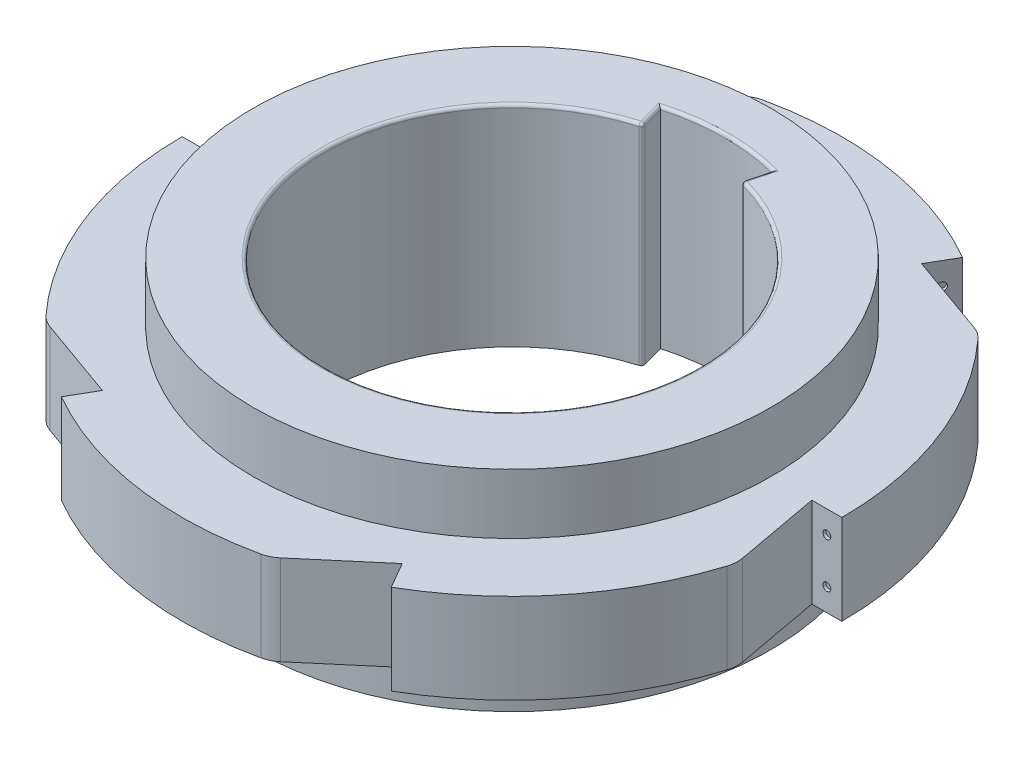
ISO-10303-21;
HEADER;
FILE_DESCRIPTION(('STEP AP214'),'2;1');
FILE_NAME('part.step','',(''),(''),'','','');
FILE_SCHEMA(('AUTOMOTIVE_DESIGN { 1 0 10303 214 1 1 1 1 }'));
ENDSEC;
DATA;
#1=APPLICATION_CONTEXT('core data for automotive mechanical design processes');
#2=APPLICATION_PROTOCOL_DEFINITION('international standard','automotive_design',2000,#1);
#3=PRODUCT_CONTEXT('',#1,'mechanical');
#4=PRODUCT('Part','Part','',(#3));
#5=PRODUCT_RELATED_PRODUCT_CATEGORY('part','',(#4));
#6=PRODUCT_DEFINITION_FORMATION('','',#4);
#7=PRODUCT_DEFINITION_CONTEXT('part definition',#1,'design');
#8=PRODUCT_DEFINITION('design','',#6,#7);
#9=PRODUCT_DEFINITION_SHAPE('','',#8);
#10=(LENGTH_UNIT() NAMED_UNIT(*) SI_UNIT(.MILLI.,.METRE.));
#11=(NAMED_UNIT(*) PLANE_ANGLE_UNIT() SI_UNIT($,.RADIAN.));
#12=(NAMED_UNIT(*) SI_UNIT($,.STERADIAN.) SOLID_ANGLE_UNIT());
#13=UNCERTAINTY_MEASURE_WITH_UNIT(LENGTH_MEASURE(1.E-05),#10,'distance_accuracy_value','');
#14=(GEOMETRIC_REPRESENTATION_CONTEXT(3) GLOBAL_UNCERTAINTY_ASSIGNED_CONTEXT((#13)) GLOBAL_UNIT_ASSIGNED_CONTEXT((#10,
#11,#12)) REPRESENTATION_CONTEXT('',''));
#15=CARTESIAN_POINT('',(0.,0.,0.));
#16=DIRECTION('',(0.,0.,1.));
#17=DIRECTION('',(1.,0.,0.));
#18=AXIS2_PLACEMENT_3D('',#15,#16,#17);
#19=CARTESIAN_POINT('',(49.9999999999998,30.,86.602540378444));
#20=DIRECTION('',(-0.647903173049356,0.,-0.761722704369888));
#21=DIRECTION('',(-0.761722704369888,0.,0.647903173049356));
#22=AXIS2_PLACEMENT_3D('',#19,#20,#21);
#23=PLANE('',#22);
#24=DIRECTION('',(0.761722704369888,0.,-0.647903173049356));
#25=VECTOR('',#24,1.);
#26=CARTESIAN_POINT('',(49.9999999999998,0.,86.602540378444));
#27=LINE('',#26,#25);
#28=CARTESIAN_POINT('',(28.0654162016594,0.,105.259574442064));
#29=VERTEX_POINT('',#28);
#30=CARTESIAN_POINT('',(49.9999999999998,0.,86.602540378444));
#31=VERTEX_POINT('',#30);
#32=EDGE_CURVE('E253',#29,#31,#27,.T.);
#33=ORIENTED_EDGE('',*,*,#32,.T.);
#34=DIRECTION('',(0.,-1.,0.));
#35=VECTOR('',#34,1.);
#36=CARTESIAN_POINT('',(49.9999999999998,30.,86.602540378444));
#37=LINE('',#36,#35);
#38=CARTESIAN_POINT('',(49.9999999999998,30.,86.602540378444));
#39=VERTEX_POINT('',#38);
#40=EDGE_CURVE('E289',#39,#31,#37,.T.);
#41=ORIENTED_EDGE('',*,*,#40,.F.);
#42=DIRECTION('',(0.761722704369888,0.,-0.647903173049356));
#43=VECTOR('',#42,1.);
#44=CARTESIAN_POINT('',(49.9999999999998,30.,86.602540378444));
#45=LINE('',#44,#43);
#46=CARTESIAN_POINT('',(28.0654162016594,30.,105.259574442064));
#47=VERTEX_POINT('',#46);
#48=EDGE_CURVE('E362',#47,#39,#45,.T.);
#49=ORIENTED_EDGE('',*,*,#48,.F.);
#50=DIRECTION('',(0.,-1.,0.));
#51=VECTOR('',#50,1.);
#52=CARTESIAN_POINT('',(28.0654162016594,30.,105.259574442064));
#53=LINE('',#52,#51);
#54=EDGE_CURVE('E412',#47,#29,#53,.T.);
#55=ORIENTED_EDGE('',*,*,#54,.T.);
#56=EDGE_LOOP('',(#33,#41,#49,#55));
#57=FACE_BOUND('',#56,.T.);
#58=ADVANCED_FACE('F34',(#57),#23,.F.);
#59=CARTESIAN_POINT('',(49.9999999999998,30.,86.602540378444));
#60=DIRECTION('',(0.86602540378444,0.,-0.499999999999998));
#61=DIRECTION('',(-0.499999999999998,0.,-0.86602540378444));
#62=AXIS2_PLACEMENT_3D('',#59,#60,#61);
#63=PLANE('',#62);
#64=CARTESIAN_POINT('',(52.4999999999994,22.5,90.9326673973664));
#65=DIRECTION('',(-0.866025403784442,0.,0.499999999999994));
#66=DIRECTION('',(-0.499999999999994,0.,-0.866025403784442));
#67=AXIS2_PLACEMENT_3D('',#64,#65,#66);
#68=CIRCLE('',#67,1.32140513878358);
#69=CARTESIAN_POINT('',(51.8392974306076,22.5,89.7882969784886));
#70=VERTEX_POINT('',#69);
#71=EDGE_CURVE('E312',#70,#70,#68,.T.);
#72=ORIENTED_EDGE('',*,*,#71,.F.);
#73=EDGE_LOOP('',(#72));
#74=FACE_BOUND('',#73,.T.);
#75=CARTESIAN_POINT('',(52.4999999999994,7.5,90.9326673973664));
#76=DIRECTION('',(-0.866025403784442,0.,0.499999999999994));
#77=DIRECTION('',(0.499999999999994,0.,0.866025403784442));
#78=AXIS2_PLACEMENT_3D('',#75,#76,#77);
#79=CIRCLE('',#78,1.32140513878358);
#80=CARTESIAN_POINT('',(53.1607025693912,7.5,92.0770378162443));
#81=VERTEX_POINT('',#80);
#82=EDGE_CURVE('E311',#81,#81,#79,.T.);
#83=ORIENTED_EDGE('',*,*,#82,.F.);
#84=EDGE_LOOP('',(#83));
#85=FACE_BOUND('',#84,.T.);
#86=DIRECTION('',(0.499999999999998,0.,0.86602540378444));
#87=VECTOR('',#86,1.);
#88=CARTESIAN_POINT('',(49.9999999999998,0.,86.602540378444));
#89=LINE('',#88,#87);
#90=CARTESIAN_POINT('',(54.9999999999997,0.,95.2627944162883));
#91=VERTEX_POINT('',#90);
#92=EDGE_CURVE('E415',#31,#91,#89,.T.);
#93=ORIENTED_EDGE('',*,*,#92,.T.);
#94=DIRECTION('',(0.,-1.,0.));
#95=VECTOR('',#94,1.);
#96=CARTESIAN_POINT('',(54.9999999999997,30.,95.2627944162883));
#97=LINE('',#96,#95);
#98=CARTESIAN_POINT('',(54.9999999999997,30.,95.2627944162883));
#99=VERTEX_POINT('',#98);
#100=EDGE_CURVE('E525',#99,#91,#97,.T.);
#101=ORIENTED_EDGE('',*,*,#100,.F.);
#102=DIRECTION('',(0.499999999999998,0.,0.86602540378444));
#103=VECTOR('',#102,1.);
#104=CARTESIAN_POINT('',(49.9999999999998,30.,86.602540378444));
#105=LINE('',#104,#103);
#106=EDGE_CURVE('E365',#39,#99,#105,.T.);
#107=ORIENTED_EDGE('',*,*,#106,.F.);
#108=ORIENTED_EDGE('',*,*,#40,.T.);
#109=EDGE_LOOP('',(#93,#101,#107,#108));
#110=FACE_BOUND('',#109,.T.);
#111=ADVANCED_FACE('F597',(#74,#85,#110),#63,.F.);
#112=CARTESIAN_POINT('',(0.,30.,0.));
#113=DIRECTION('',(0.,-1.,0.));
#114=DIRECTION('',(0.,0.,-1.));
#115=AXIS2_PLACEMENT_3D('',#112,#113,#114);
#116=CYLINDRICAL_SURFACE('',#115,110.);
#117=CARTESIAN_POINT('',(0.,0.,0.));
#118=DIRECTION('',(0.,1.,0.));
#119=DIRECTION('',(0.,0.,-1.));
#120=AXIS2_PLACEMENT_3D('',#117,#118,#119);
#121=CIRCLE('',#120,110.);
#122=CARTESIAN_POINT('',(104.889340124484,0.,33.1394980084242));
#123=VERTEX_POINT('',#122);
#124=EDGE_CURVE('E417',#91,#123,#121,.T.);
#125=ORIENTED_EDGE('',*,*,#124,.T.);
#126=DIRECTION('',(0.,-1.,0.));
#127=VECTOR('',#126,1.);
#128=CARTESIAN_POINT('',(104.889340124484,30.,33.1394980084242));
#129=LINE('',#128,#127);
#130=CARTESIAN_POINT('',(104.889340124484,30.,33.1394980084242));
#131=VERTEX_POINT('',#130);
#132=EDGE_CURVE('E522',#131,#123,#129,.T.);
#133=ORIENTED_EDGE('',*,*,#132,.F.);
#134=CARTESIAN_POINT('',(0.,30.,0.));
#135=DIRECTION('',(0.,1.,0.));
#136=DIRECTION('',(0.,0.,-1.));
#137=AXIS2_PLACEMENT_3D('',#134,#135,#136);
#138=CIRCLE('',#137,110.);
#139=EDGE_CURVE('E368',#99,#131,#138,.T.);
#140=ORIENTED_EDGE('',*,*,#139,.F.);
#141=ORIENTED_EDGE('',*,*,#100,.T.);
#142=EDGE_LOOP('',(#125,#133,#140,#141));
#143=FACE_BOUND('',#142,.T.);
#144=ADVANCED_FACE('F603',(#143),#116,.T.);
#145=CARTESIAN_POINT('',(95.3539455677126,30.,30.1268163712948));
#146=DIRECTION('',(0.,-1.,0.));
#147=DIRECTION('',(0.,0.,-1.));
#148=AXIS2_PLACEMENT_3D('',#145,#146,#147);
#149=CYLINDRICAL_SURFACE('',#148,9.99999999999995);
#150=CARTESIAN_POINT('',(95.3539455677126,0.,30.1268163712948));
#151=DIRECTION('',(0.,1.,0.));
#152=DIRECTION('',(0.,0.,-1.));
#153=AXIS2_PLACEMENT_3D('',#150,#151,#152);
#154=CIRCLE('',#153,9.99999999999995);
#155=CARTESIAN_POINT('',(105.190173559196,0.,28.3244238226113));
#156=VERTEX_POINT('',#155);
#157=EDGE_CURVE('E419',#123,#156,#154,.T.);
#158=ORIENTED_EDGE('',*,*,#157,.T.);
#159=DIRECTION('',(0.,-1.,0.));
#160=VECTOR('',#159,1.);
#161=CARTESIAN_POINT('',(105.190173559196,30.,28.3244238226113));
#162=LINE('',#161,#160);
#163=CARTESIAN_POINT('',(105.190173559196,30.,28.3244238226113));
#164=VERTEX_POINT('',#163);
#165=EDGE_CURVE('E519',#164,#156,#162,.T.);
#166=ORIENTED_EDGE('',*,*,#165,.F.);
#167=CARTESIAN_POINT('',(95.3539455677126,30.,30.1268163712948));
#168=DIRECTION('',(0.,1.,0.));
#169=DIRECTION('',(0.,0.,-1.));
#170=AXIS2_PLACEMENT_3D('',#167,#168,#169);
#171=CIRCLE('',#170,9.99999999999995);
#172=EDGE_CURVE('E370',#131,#164,#171,.T.);
#173=ORIENTED_EDGE('',*,*,#172,.F.);
#174=ORIENTED_EDGE('',*,*,#132,.T.);
#175=EDGE_LOOP('',(#158,#166,#173,#174));
#176=FACE_BOUND('',#175,.T.);
#177=ADVANCED_FACE('F609',(#176),#149,.T.);
#178=CARTESIAN_POINT('',(100.,30.,0.));
#179=DIRECTION('',(-0.983622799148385,0.,0.180239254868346));
#180=DIRECTION('',(0.180239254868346,0.,0.983622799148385));
#181=AXIS2_PLACEMENT_3D('',#178,#179,#180);
#182=PLANE('',#181);
#183=DIRECTION('',(-0.180239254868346,0.,-0.983622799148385));
#184=VECTOR('',#183,1.);
#185=CARTESIAN_POINT('',(100.,0.,0.));
#186=LINE('',#185,#184);
#187=CARTESIAN_POINT('',(100.,0.,0.));
#188=VERTEX_POINT('',#187);
#189=EDGE_CURVE('E421',#156,#188,#186,.T.);
#190=ORIENTED_EDGE('',*,*,#189,.T.);
#191=DIRECTION('',(0.,-1.,0.));
#192=VECTOR('',#191,1.);
#193=CARTESIAN_POINT('',(100.,30.,0.));
#194=LINE('',#193,#192);
#195=CARTESIAN_POINT('',(100.,30.,0.));
#196=VERTEX_POINT('',#195);
#197=EDGE_CURVE('E516',#196,#188,#194,.T.);
#198=ORIENTED_EDGE('',*,*,#197,.F.);
#199=DIRECTION('',(-0.180239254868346,0.,-0.983622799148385));
#200=VECTOR('',#199,1.);
#201=CARTESIAN_POINT('',(100.,30.,0.));
#202=LINE('',#201,#200);
#203=EDGE_CURVE('E372',#164,#196,#202,.T.);
#204=ORIENTED_EDGE('',*,*,#203,.F.);
#205=ORIENTED_EDGE('',*,*,#165,.T.);
#206=EDGE_LOOP('',(#190,#198,#204,#205));
#207=FACE_BOUND('',#206,.T.);
#208=ADVANCED_FACE('F613',(#207),#182,.F.);
#209=CARTESIAN_POINT('',(100.,30.,0.));
#210=DIRECTION('',(1.24900090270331E-13,0.,-1.));
#211=DIRECTION('',(-1.,0.,-1.24900090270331E-13));
#212=AXIS2_PLACEMENT_3D('',#209,#210,#211);
#213=PLANE('',#212);
#214=CARTESIAN_POINT('',(105.,7.5,-2.70616862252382E-13));
#215=DIRECTION('',(0.,0.,1.));
#216=DIRECTION('',(1.,0.,0.));
#217=AXIS2_PLACEMENT_3D('',#214,#215,#216);
#218=CIRCLE('',#217,1.32140513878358);
#219=CARTESIAN_POINT('',(106.321405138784,7.5,-2.74137792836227E-13));
#220=VERTEX_POINT('',#219);
#221=EDGE_CURVE('E299',#220,#220,#218,.T.);
#222=ORIENTED_EDGE('',*,*,#221,.F.);
#223=EDGE_LOOP('',(#222));
#224=FACE_BOUND('',#223,.T.);
#225=CARTESIAN_POINT('',(105.,22.5,-2.70616862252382E-13));
#226=DIRECTION('',(0.,0.,1.));
#227=DIRECTION('',(-1.,0.,0.));
#228=AXIS2_PLACEMENT_3D('',#225,#226,#227);
#229=CIRCLE('',#228,1.32140513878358);
#230=CARTESIAN_POINT('',(103.678594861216,22.5,-2.67095931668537E-13));
#231=VERTEX_POINT('',#230);
#232=EDGE_CURVE('E300',#231,#231,#229,.T.);
#233=ORIENTED_EDGE('',*,*,#232,.F.);
#234=EDGE_LOOP('',(#233));
#235=FACE_BOUND('',#234,.T.);
#236=DIRECTION('',(1.,0.,1.24900090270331E-13));
#237=VECTOR('',#236,1.);
#238=CARTESIAN_POINT('',(100.,0.,0.));
#239=LINE('',#238,#237);
#240=CARTESIAN_POINT('',(110.,0.,1.2490009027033E-12));
#241=VERTEX_POINT('',#240);
#242=EDGE_CURVE('E423',#188,#241,#239,.T.);
#243=ORIENTED_EDGE('',*,*,#242,.T.);
#244=DIRECTION('',(0.,-1.,0.));
#245=VECTOR('',#244,1.);
#246=CARTESIAN_POINT('',(110.,30.,1.2490009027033E-12));
#247=LINE('',#246,#245);
#248=CARTESIAN_POINT('',(110.,30.,1.2490009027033E-12));
#249=VERTEX_POINT('',#248);
#250=EDGE_CURVE('E513',#249,#241,#247,.T.);
#251=ORIENTED_EDGE('',*,*,#250,.F.);
#252=DIRECTION('',(1.,0.,1.24900090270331E-13));
#253=VECTOR('',#252,1.);
#254=CARTESIAN_POINT('',(100.,30.,0.));
#255=LINE('',#254,#253);
#256=EDGE_CURVE('E374',#196,#249,#255,.T.);
#257=ORIENTED_EDGE('',*,*,#256,.F.);
#258=ORIENTED_EDGE('',*,*,#197,.T.);
#259=EDGE_LOOP('',(#243,#251,#257,#258));
#260=FACE_BOUND('',#259,.T.);
#261=ADVANCED_FACE('F617',(#224,#235,#260),#213,.F.);
#262=CARTESIAN_POINT('',(0.,30.,0.));
#263=DIRECTION('',(0.,-1.,0.));
#264=DIRECTION('',(0.,0.,-1.));
#265=AXIS2_PLACEMENT_3D('',#262,#263,#264);
#266=CYLINDRICAL_SURFACE('',#265,110.);
#267=CARTESIAN_POINT('',(0.,0.,0.));
#268=DIRECTION('',(0.,1.,0.));
#269=DIRECTION('',(0.,0.,-1.));
#270=AXIS2_PLACEMENT_3D('',#267,#268,#269);
#271=CIRCLE('',#270,110.);
#272=CARTESIAN_POINT('',(81.144317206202,0.,-74.2670841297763));
#273=VERTEX_POINT('',#272);
#274=EDGE_CURVE('E425',#241,#273,#271,.T.);
#275=ORIENTED_EDGE('',*,*,#274,.T.);
#276=DIRECTION('',(0.,-1.,0.));
#277=VECTOR('',#276,1.);
#278=CARTESIAN_POINT('',(81.144317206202,30.,-74.2670841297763));
#279=LINE('',#278,#277);
#280=CARTESIAN_POINT('',(81.144317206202,30.,-74.2670841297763));
#281=VERTEX_POINT('',#280);
#282=EDGE_CURVE('E510',#281,#273,#279,.T.);
#283=ORIENTED_EDGE('',*,*,#282,.F.);
#284=CARTESIAN_POINT('',(0.,30.,0.));
#285=DIRECTION('',(0.,1.,0.));
#286=DIRECTION('',(0.,0.,-1.));
#287=AXIS2_PLACEMENT_3D('',#284,#285,#286);
#288=CIRCLE('',#287,110.);
#289=EDGE_CURVE('E376',#249,#281,#288,.T.);
#290=ORIENTED_EDGE('',*,*,#289,.F.);
#291=ORIENTED_EDGE('',*,*,#250,.T.);
#292=EDGE_LOOP('',(#275,#283,#290,#291));
#293=FACE_BOUND('',#292,.T.);
#294=ADVANCED_FACE('F621',(#293),#266,.T.);
#295=CARTESIAN_POINT('',(73.7675610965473,30.,-67.5155310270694));
#296=DIRECTION('',(0.,-1.,0.));
#297=DIRECTION('',(0.,0.,-1.));
#298=AXIS2_PLACEMENT_3D('',#295,#296,#297);
#299=CYLINDRICAL_SURFACE('',#298,9.99999999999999);
#300=CARTESIAN_POINT('',(73.7675610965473,0.,-67.5155310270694));
#301=DIRECTION('',(0.,1.,0.));
#302=DIRECTION('',(0.,0.,-1.));
#303=AXIS2_PLACEMENT_3D('',#300,#301,#302);
#304=CIRCLE('',#303,9.99999999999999);
#305=CARTESIAN_POINT('',(77.1247573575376,0.,-76.9351506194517));
#306=VERTEX_POINT('',#305);
#307=EDGE_CURVE('E427',#273,#306,#304,.T.);
#308=ORIENTED_EDGE('',*,*,#307,.T.);
#309=DIRECTION('',(0.,-1.,0.));
#310=VECTOR('',#309,1.);
#311=CARTESIAN_POINT('',(77.1247573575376,30.,-76.9351506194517));
#312=LINE('',#311,#310);
#313=CARTESIAN_POINT('',(77.1247573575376,30.,-76.9351506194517));
#314=VERTEX_POINT('',#313);
#315=EDGE_CURVE('E507',#314,#306,#312,.T.);
#316=ORIENTED_EDGE('',*,*,#315,.F.);
#317=CARTESIAN_POINT('',(73.7675610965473,30.,-67.5155310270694));
#318=DIRECTION('',(0.,1.,0.));
#319=DIRECTION('',(0.,0.,-1.));
#320=AXIS2_PLACEMENT_3D('',#317,#318,#319);
#321=CIRCLE('',#320,9.99999999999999);
#322=EDGE_CURVE('E378',#281,#314,#321,.T.);
#323=ORIENTED_EDGE('',*,*,#322,.F.);
#324=ORIENTED_EDGE('',*,*,#282,.T.);
#325=EDGE_LOOP('',(#308,#316,#323,#324));
#326=FACE_BOUND('',#325,.T.);
#327=ADVANCED_FACE('F625',(#326),#299,.T.);
#328=CARTESIAN_POINT('',(50.0000000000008,30.,-86.6025403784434));
#329=DIRECTION('',(-0.33571962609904,0.,0.941961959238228));
#330=DIRECTION('',(0.941961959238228,0.,0.33571962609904));
#331=AXIS2_PLACEMENT_3D('',#328,#329,#330);
#332=PLANE('',#331);
#333=DIRECTION('',(-0.941961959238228,0.,-0.33571962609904));
#334=VECTOR('',#333,1.);
#335=CARTESIAN_POINT('',(50.0000000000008,0.,-86.6025403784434));
#336=LINE('',#335,#334);
#337=CARTESIAN_POINT('',(50.0000000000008,0.,-86.6025403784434));
#338=VERTEX_POINT('',#337);
#339=EDGE_CURVE('E429',#306,#338,#336,.T.);
#340=ORIENTED_EDGE('',*,*,#339,.T.);
#341=DIRECTION('',(0.,-1.,0.));
#342=VECTOR('',#341,1.);
#343=CARTESIAN_POINT('',(50.0000000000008,30.,-86.6025403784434));
#344=LINE('',#343,#342);
#345=CARTESIAN_POINT('',(50.0000000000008,30.,-86.6025403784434));
#346=VERTEX_POINT('',#345);
#347=EDGE_CURVE('E504',#346,#338,#344,.T.);
#348=ORIENTED_EDGE('',*,*,#347,.F.);
#349=DIRECTION('',(-0.941961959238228,0.,-0.33571962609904));
#350=VECTOR('',#349,1.);
#351=CARTESIAN_POINT('',(50.0000000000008,30.,-86.6025403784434));
#352=LINE('',#351,#350);
#353=EDGE_CURVE('E380',#314,#346,#352,.T.);
#354=ORIENTED_EDGE('',*,*,#353,.F.);
#355=ORIENTED_EDGE('',*,*,#315,.T.);
#356=EDGE_LOOP('',(#340,#348,#354,#355));
#357=FACE_BOUND('',#356,.T.);
#358=ADVANCED_FACE('F629',(#357),#332,.F.);
#359=CARTESIAN_POINT('',(50.0000000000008,30.,-86.6025403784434));
#360=DIRECTION('',(-0.866025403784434,0.,-0.500000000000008));
#361=DIRECTION('',(-0.500000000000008,0.,0.866025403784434));
#362=AXIS2_PLACEMENT_3D('',#359,#360,#361);
#363=PLANE('',#362);
#364=CARTESIAN_POINT('',(52.4999999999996,7.5,-90.9326673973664));
#365=DIRECTION('',(0.866025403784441,0.,0.499999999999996));
#366=DIRECTION('',(0.499999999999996,0.,-0.866025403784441));
#367=AXIS2_PLACEMENT_3D('',#364,#365,#366);
#368=CIRCLE('',#367,1.32140513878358);
#369=CARTESIAN_POINT('',(53.1607025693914,7.5,-92.0770378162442));
#370=VERTEX_POINT('',#369);
#371=EDGE_CURVE('E293',#370,#370,#368,.T.);
#372=ORIENTED_EDGE('',*,*,#371,.F.);
#373=EDGE_LOOP('',(#372));
#374=FACE_BOUND('',#373,.T.);
#375=CARTESIAN_POINT('',(52.4999999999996,22.5,-90.9326673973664));
#376=DIRECTION('',(0.866025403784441,0.,0.499999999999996));
#377=DIRECTION('',(-0.499999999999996,0.,0.866025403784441));
#378=AXIS2_PLACEMENT_3D('',#375,#376,#377);
#379=CIRCLE('',#378,1.32140513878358);
#380=CARTESIAN_POINT('',(51.8392974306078,22.5,-89.7882969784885));
#381=VERTEX_POINT('',#380);
#382=EDGE_CURVE('E284',#381,#381,#379,.T.);
#383=ORIENTED_EDGE('',*,*,#382,.F.);
#384=EDGE_LOOP('',(#383));
#385=FACE_BOUND('',#384,.T.);
#386=DIRECTION('',(0.500000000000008,0.,-0.866025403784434));
#387=VECTOR('',#386,1.);
#388=CARTESIAN_POINT('',(50.0000000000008,0.,-86.6025403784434));
#389=LINE('',#388,#387);
#390=CARTESIAN_POINT('',(55.0000000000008,0.,-95.2627944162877));
#391=VERTEX_POINT('',#390);
#392=EDGE_CURVE('E431',#338,#391,#389,.T.);
#393=ORIENTED_EDGE('',*,*,#392,.T.);
#394=DIRECTION('',(0.,-1.,0.));
#395=VECTOR('',#394,1.);
#396=CARTESIAN_POINT('',(55.0000000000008,30.,-95.2627944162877));
#397=LINE('',#396,#395);
#398=CARTESIAN_POINT('',(55.0000000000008,30.,-95.2627944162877));
#399=VERTEX_POINT('',#398);
#400=EDGE_CURVE('E501',#399,#391,#397,.T.);
#401=ORIENTED_EDGE('',*,*,#400,.F.);
#402=DIRECTION('',(0.500000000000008,0.,-0.866025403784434));
#403=VECTOR('',#402,1.);
#404=CARTESIAN_POINT('',(50.0000000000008,30.,-86.6025403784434));
#405=LINE('',#404,#403);
#406=EDGE_CURVE('E382',#346,#399,#405,.T.);
#407=ORIENTED_EDGE('',*,*,#406,.F.);
#408=ORIENTED_EDGE('',*,*,#347,.T.);
#409=EDGE_LOOP('',(#393,#401,#407,#408));
#410=FACE_BOUND('',#409,.T.);
#411=ADVANCED_FACE('F633',(#374,#385,#410),#363,.F.);
#412=CARTESIAN_POINT('',(0.,30.,0.));
#413=DIRECTION('',(0.,-1.,0.));
#414=DIRECTION('',(0.,0.,-1.));
#415=AXIS2_PLACEMENT_3D('',#412,#413,#414);
#416=CYLINDRICAL_SURFACE('',#415,110.);
#417=CARTESIAN_POINT('',(0.,0.,0.));
#418=DIRECTION('',(0.,1.,0.));
#419=DIRECTION('',(0.,0.,-1.));
#420=AXIS2_PLACEMENT_3D('',#417,#418,#419);
#421=CIRCLE('',#420,110.);
#422=CARTESIAN_POINT('',(-23.7450229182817,0.,-107.406582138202));
#423=VERTEX_POINT('',#422);
#424=EDGE_CURVE('E433',#391,#423,#421,.T.);
#425=ORIENTED_EDGE('',*,*,#424,.T.);
#426=DIRECTION('',(0.,-1.,0.));
#427=VECTOR('',#426,1.);
#428=CARTESIAN_POINT('',(-23.7450229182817,30.,-107.406582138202));
#429=LINE('',#428,#427);
#430=CARTESIAN_POINT('',(-23.7450229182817,30.,-107.406582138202));
#431=VERTEX_POINT('',#430);
#432=EDGE_CURVE('E498',#431,#423,#429,.T.);
#433=ORIENTED_EDGE('',*,*,#432,.F.);
#434=CARTESIAN_POINT('',(0.,30.,0.));
#435=DIRECTION('',(0.,1.,0.));
#436=DIRECTION('',(0.,0.,-1.));
#437=AXIS2_PLACEMENT_3D('',#434,#435,#436);
#438=CIRCLE('',#437,110.);
#439=EDGE_CURVE('E384',#399,#431,#438,.T.);
#440=ORIENTED_EDGE('',*,*,#439,.F.);
#441=ORIENTED_EDGE('',*,*,#400,.T.);
#442=EDGE_LOOP('',(#425,#433,#440,#441));
#443=FACE_BOUND('',#442,.T.);
#444=ADVANCED_FACE('F637',(#443),#416,.T.);
#445=CARTESIAN_POINT('',(-21.5863844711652,30.,-97.6423473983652));
#446=DIRECTION('',(0.,-1.,0.));
#447=DIRECTION('',(0.,0.,-1.));
#448=AXIS2_PLACEMENT_3D('',#445,#446,#447);
#449=CYLINDRICAL_SURFACE('',#448,9.99999999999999);
#450=CARTESIAN_POINT('',(-21.5863844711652,0.,-97.6423473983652));
#451=DIRECTION('',(0.,1.,0.));
#452=DIRECTION('',(0.,0.,-1.));
#453=AXIS2_PLACEMENT_3D('',#450,#451,#452);
#454=CIRCLE('',#453,9.99999999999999);
#455=CARTESIAN_POINT('',(-28.0654162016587,0.,-105.259574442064));
#456=VERTEX_POINT('',#455);
#457=EDGE_CURVE('E435',#423,#456,#454,.T.);
#458=ORIENTED_EDGE('',*,*,#457,.T.);
#459=DIRECTION('',(0.,-1.,0.));
#460=VECTOR('',#459,1.);
#461=CARTESIAN_POINT('',(-28.0654162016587,30.,-105.259574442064));
#462=LINE('',#461,#460);
#463=CARTESIAN_POINT('',(-28.0654162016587,30.,-105.259574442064));
#464=VERTEX_POINT('',#463);
#465=EDGE_CURVE('E495',#464,#456,#462,.T.);
#466=ORIENTED_EDGE('',*,*,#465,.F.);
#467=CARTESIAN_POINT('',(-21.5863844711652,30.,-97.6423473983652));
#468=DIRECTION('',(0.,1.,0.));
#469=DIRECTION('',(0.,0.,-1.));
#470=AXIS2_PLACEMENT_3D('',#467,#468,#469);
#471=CIRCLE('',#470,9.99999999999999);
#472=EDGE_CURVE('E386',#431,#464,#471,.T.);
#473=ORIENTED_EDGE('',*,*,#472,.F.);
#474=ORIENTED_EDGE('',*,*,#432,.T.);
#475=EDGE_LOOP('',(#458,#466,#473,#474));
#476=FACE_BOUND('',#475,.T.);
#477=ADVANCED_FACE('F641',(#476),#449,.T.);
#478=CARTESIAN_POINT('',(-49.9999999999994,30.,-86.6025403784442));
#479=DIRECTION('',(0.64790317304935,0.,0.761722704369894));
#480=DIRECTION('',(0.761722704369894,0.,-0.64790317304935));
#481=AXIS2_PLACEMENT_3D('',#478,#479,#480);
#482=PLANE('',#481);
#483=DIRECTION('',(-0.761722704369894,0.,0.64790317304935));
#484=VECTOR('',#483,1.);
#485=CARTESIAN_POINT('',(-49.9999999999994,0.,-86.6025403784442));
#486=LINE('',#485,#484);
#487=CARTESIAN_POINT('',(-49.9999999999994,0.,-86.6025403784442));
#488=VERTEX_POINT('',#487);
#489=EDGE_CURVE('E437',#456,#488,#486,.T.);
#490=ORIENTED_EDGE('',*,*,#489,.T.);
#491=DIRECTION('',(0.,-1.,0.));
#492=VECTOR('',#491,1.);
#493=CARTESIAN_POINT('',(-49.9999999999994,30.,-86.6025403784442));
#494=LINE('',#493,#492);
#495=CARTESIAN_POINT('',(-49.9999999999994,30.,-86.6025403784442));
#496=VERTEX_POINT('',#495);
#497=EDGE_CURVE('E492',#496,#488,#494,.T.);
#498=ORIENTED_EDGE('',*,*,#497,.F.);
#499=DIRECTION('',(-0.761722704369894,0.,0.64790317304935));
#500=VECTOR('',#499,1.);
#501=CARTESIAN_POINT('',(-49.9999999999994,30.,-86.6025403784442));
#502=LINE('',#501,#500);
#503=EDGE_CURVE('E388',#464,#496,#502,.T.);
#504=ORIENTED_EDGE('',*,*,#503,.F.);
#505=ORIENTED_EDGE('',*,*,#465,.T.);
#506=EDGE_LOOP('',(#490,#498,#504,#505));
#507=FACE_BOUND('',#506,.T.);
#508=ADVANCED_FACE('F645',(#507),#482,.F.);
#509=CARTESIAN_POINT('',(-49.9999999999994,30.,-86.6025403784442));
#510=DIRECTION('',(-0.866025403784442,0.,0.499999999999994));
#511=DIRECTION('',(0.499999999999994,0.,0.866025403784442));
#512=AXIS2_PLACEMENT_3D('',#509,#510,#511);
#513=PLANE('',#512);
#514=CARTESIAN_POINT('',(-52.4999999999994,7.5,-90.9326673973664));
#515=DIRECTION('',(0.866025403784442,0.,-0.499999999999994));
#516=DIRECTION('',(-0.499999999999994,0.,-0.866025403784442));
#517=AXIS2_PLACEMENT_3D('',#514,#515,#516);
#518=CIRCLE('',#517,1.32140513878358);
#519=CARTESIAN_POINT('',(-53.1607025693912,7.5,-92.0770378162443));
#520=VERTEX_POINT('',#519);
#521=EDGE_CURVE('E353',#520,#520,#518,.T.);
#522=ORIENTED_EDGE('',*,*,#521,.F.);
#523=EDGE_LOOP('',(#522));
#524=FACE_BOUND('',#523,.T.);
#525=CARTESIAN_POINT('',(-52.4999999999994,22.5,-90.9326673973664));
#526=DIRECTION('',(0.866025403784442,0.,-0.499999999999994));
#527=DIRECTION('',(0.499999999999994,0.,0.866025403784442));
#528=AXIS2_PLACEMENT_3D('',#525,#526,#527);
#529=CIRCLE('',#528,1.32140513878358);
#530=CARTESIAN_POINT('',(-51.8392974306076,22.5,-89.7882969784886));
#531=VERTEX_POINT('',#530);
#532=EDGE_CURVE('E347',#531,#531,#529,.T.);
#533=ORIENTED_EDGE('',*,*,#532,.F.);
#534=EDGE_LOOP('',(#533));
#535=FACE_BOUND('',#534,.T.);
#536=DIRECTION('',(-0.499999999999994,0.,-0.866025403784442));
#537=VECTOR('',#536,1.);
#538=CARTESIAN_POINT('',(-49.9999999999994,0.,-86.6025403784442));
#539=LINE('',#538,#537);
#540=CARTESIAN_POINT('',(-54.9999999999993,0.,-95.2627944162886));
#541=VERTEX_POINT('',#540);
#542=EDGE_CURVE('E439',#488,#541,#539,.T.);
#543=ORIENTED_EDGE('',*,*,#542,.T.);
#544=DIRECTION('',(0.,-1.,0.));
#545=VECTOR('',#544,1.);
#546=CARTESIAN_POINT('',(-54.9999999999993,30.,-95.2627944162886));
#547=LINE('',#546,#545);
#548=CARTESIAN_POINT('',(-54.9999999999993,30.,-95.2627944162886));
#549=VERTEX_POINT('',#548);
#550=EDGE_CURVE('E489',#549,#541,#547,.T.);
#551=ORIENTED_EDGE('',*,*,#550,.F.);
#552=DIRECTION('',(-0.499999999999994,0.,-0.866025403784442));
#553=VECTOR('',#552,1.);
#554=CARTESIAN_POINT('',(-49.9999999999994,30.,-86.6025403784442));
#555=LINE('',#554,#553);
#556=EDGE_CURVE('E390',#496,#549,#555,.T.);
#557=ORIENTED_EDGE('',*,*,#556,.F.);
#558=ORIENTED_EDGE('',*,*,#497,.T.);
#559=EDGE_LOOP('',(#543,#551,#557,#558));
#560=FACE_BOUND('',#559,.T.);
#561=ADVANCED_FACE('F649',(#524,#535,#560),#513,.F.);
#562=CARTESIAN_POINT('',(0.,30.,0.));
#563=DIRECTION('',(0.,-1.,0.));
#564=DIRECTION('',(0.,0.,-1.));
#565=AXIS2_PLACEMENT_3D('',#562,#563,#564);
#566=CYLINDRICAL_SURFACE('',#565,110.);
#567=CARTESIAN_POINT('',(0.,0.,0.));
#568=DIRECTION('',(0.,1.,0.));
#569=DIRECTION('',(0.,0.,-1.));
#570=AXIS2_PLACEMENT_3D('',#567,#568,#569);
#571=CIRCLE('',#570,110.);
#572=CARTESIAN_POINT('',(-104.889340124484,0.,-33.139498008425));
#573=VERTEX_POINT('',#572);
#574=EDGE_CURVE('E441',#541,#573,#571,.T.);
#575=ORIENTED_EDGE('',*,*,#574,.T.);
#576=DIRECTION('',(0.,-1.,0.));
#577=VECTOR('',#576,1.);
#578=CARTESIAN_POINT('',(-104.889340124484,30.,-33.139498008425));
#579=LINE('',#578,#577);
#580=CARTESIAN_POINT('',(-104.889340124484,30.,-33.139498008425));
#581=VERTEX_POINT('',#580);
#582=EDGE_CURVE('E486',#581,#573,#579,.T.);
#583=ORIENTED_EDGE('',*,*,#582,.F.);
#584=CARTESIAN_POINT('',(0.,30.,0.));
#585=DIRECTION('',(0.,1.,0.));
#586=DIRECTION('',(0.,0.,-1.));
#587=AXIS2_PLACEMENT_3D('',#584,#585,#586);
#588=CIRCLE('',#587,110.);
#589=EDGE_CURVE('E392',#549,#581,#588,.T.);
#590=ORIENTED_EDGE('',*,*,#589,.F.);
#591=ORIENTED_EDGE('',*,*,#550,.T.);
#592=EDGE_LOOP('',(#575,#583,#590,#591));
#593=FACE_BOUND('',#592,.T.);
#594=ADVANCED_FACE('F653',(#593),#566,.T.);
#595=CARTESIAN_POINT('',(-95.3539455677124,30.,-30.1268163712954));
#596=DIRECTION('',(0.,-1.,0.));
#597=DIRECTION('',(0.,0.,-1.));
#598=AXIS2_PLACEMENT_3D('',#595,#596,#597);
#599=CYLINDRICAL_SURFACE('',#598,9.99999999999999);
#600=CARTESIAN_POINT('',(-95.3539455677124,0.,-30.1268163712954));
#601=DIRECTION('',(0.,1.,0.));
#602=DIRECTION('',(0.,0.,-1.));
#603=AXIS2_PLACEMENT_3D('',#600,#601,#602);
#604=CIRCLE('',#603,9.99999999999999);
#605=CARTESIAN_POINT('',(-105.190173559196,0.,-28.324423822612));
#606=VERTEX_POINT('',#605);
#607=EDGE_CURVE('E443',#573,#606,#604,.T.);
#608=ORIENTED_EDGE('',*,*,#607,.T.);
#609=DIRECTION('',(0.,-1.,0.));
#610=VECTOR('',#609,1.);
#611=CARTESIAN_POINT('',(-105.190173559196,30.,-28.324423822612));
#612=LINE('',#611,#610);
#613=CARTESIAN_POINT('',(-105.190173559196,30.,-28.324423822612));
#614=VERTEX_POINT('',#613);
#615=EDGE_CURVE('E483',#614,#606,#612,.T.);
#616=ORIENTED_EDGE('',*,*,#615,.F.);
#617=CARTESIAN_POINT('',(-95.3539455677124,30.,-30.1268163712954));
#618=DIRECTION('',(0.,1.,0.));
#619=DIRECTION('',(0.,0.,-1.));
#620=AXIS2_PLACEMENT_3D('',#617,#618,#619);
#621=CIRCLE('',#620,9.99999999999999);
#622=EDGE_CURVE('E394',#581,#614,#621,.T.);
#623=ORIENTED_EDGE('',*,*,#622,.F.);
#624=ORIENTED_EDGE('',*,*,#582,.T.);
#625=EDGE_LOOP('',(#608,#616,#623,#624));
#626=FACE_BOUND('',#625,.T.);
#627=ADVANCED_FACE('F657',(#626),#599,.T.);
#628=CARTESIAN_POINT('',(-100.,30.,-4.44089209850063E-13));
#629=DIRECTION('',(0.983622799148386,0.,-0.180239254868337));
#630=DIRECTION('',(-0.180239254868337,0.,-0.983622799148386));
#631=AXIS2_PLACEMENT_3D('',#628,#629,#630);
#632=PLANE('',#631);
#633=DIRECTION('',(0.180239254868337,0.,0.983622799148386));
#634=VECTOR('',#633,1.);
#635=CARTESIAN_POINT('',(-100.,0.,-4.44089209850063E-13));
#636=LINE('',#635,#634);
#637=CARTESIAN_POINT('',(-100.,0.,-4.44089209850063E-13));
#638=VERTEX_POINT('',#637);
#639=EDGE_CURVE('E445',#606,#638,#636,.T.);
#640=ORIENTED_EDGE('',*,*,#639,.T.);
#641=DIRECTION('',(0.,-1.,0.));
#642=VECTOR('',#641,1.);
#643=CARTESIAN_POINT('',(-100.,30.,-4.44089209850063E-13));
#644=LINE('',#643,#642);
#645=CARTESIAN_POINT('',(-100.,30.,-4.44089209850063E-13));
#646=VERTEX_POINT('',#645);
#647=EDGE_CURVE('E480',#646,#638,#644,.T.);
#648=ORIENTED_EDGE('',*,*,#647,.F.);
#649=DIRECTION('',(0.180239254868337,0.,0.983622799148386));
#650=VECTOR('',#649,1.);
#651=CARTESIAN_POINT('',(-100.,30.,-4.44089209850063E-13));
#652=LINE('',#651,#650);
#653=EDGE_CURVE('E396',#614,#646,#652,.T.);
#654=ORIENTED_EDGE('',*,*,#653,.F.);
#655=ORIENTED_EDGE('',*,*,#615,.T.);
#656=EDGE_LOOP('',(#640,#648,#654,#655));
#657=FACE_BOUND('',#656,.T.);
#658=ADVANCED_FACE('F661',(#657),#632,.F.);
#659=CARTESIAN_POINT('',(-100.,30.,-4.44089209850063E-13));
#660=DIRECTION('',(0.,0.,1.));
#661=DIRECTION('',(1.,0.,0.));
#662=AXIS2_PLACEMENT_3D('',#659,#660,#661);
#663=PLANE('',#662);
#664=CARTESIAN_POINT('',(-105.,22.5,-4.64905891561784E-13));
#665=DIRECTION('',(0.,0.,-1.));
#666=DIRECTION('',(1.,0.,0.));
#667=AXIS2_PLACEMENT_3D('',#664,#665,#666);
#668=CIRCLE('',#667,1.32140513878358);
#669=CARTESIAN_POINT('',(-103.678594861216,22.5,-4.59184379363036E-13));
#670=VERTEX_POINT('',#669);
#671=EDGE_CURVE('E336',#670,#670,#668,.T.);
#672=ORIENTED_EDGE('',*,*,#671,.F.);
#673=EDGE_LOOP('',(#672));
#674=FACE_BOUND('',#673,.T.);
#675=CARTESIAN_POINT('',(-105.,7.5,-4.64905891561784E-13));
#676=DIRECTION('',(0.,0.,-1.));
#677=DIRECTION('',(-1.,0.,0.));
#678=AXIS2_PLACEMENT_3D('',#675,#676,#677);
#679=CIRCLE('',#678,1.32140513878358);
#680=CARTESIAN_POINT('',(-106.321405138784,7.5,-4.70627403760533E-13));
#681=VERTEX_POINT('',#680);
#682=EDGE_CURVE('E335',#681,#681,#679,.T.);
#683=ORIENTED_EDGE('',*,*,#682,.F.);
#684=EDGE_LOOP('',(#683));
#685=FACE_BOUND('',#684,.T.);
#686=DIRECTION('',(-1.,0.,0.));
#687=VECTOR('',#686,1.);
#688=CARTESIAN_POINT('',(-100.,0.,-4.44089209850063E-13));
#689=LINE('',#688,#687);
#690=CARTESIAN_POINT('',(-110.,0.,-5.06539254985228E-13));
#691=VERTEX_POINT('',#690);
#692=EDGE_CURVE('E447',#638,#691,#689,.T.);
#693=ORIENTED_EDGE('',*,*,#692,.T.);
#694=DIRECTION('',(0.,-1.,0.));
#695=VECTOR('',#694,1.);
#696=CARTESIAN_POINT('',(-110.,30.,-5.06539254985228E-13));
#697=LINE('',#696,#695);
#698=CARTESIAN_POINT('',(-110.,30.,-5.06539254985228E-13));
#699=VERTEX_POINT('',#698);
#700=EDGE_CURVE('E477',#699,#691,#697,.T.);
#701=ORIENTED_EDGE('',*,*,#700,.F.);
#702=DIRECTION('',(-1.,0.,0.));
#703=VECTOR('',#702,1.);
#704=CARTESIAN_POINT('',(-100.,30.,-4.44089209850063E-13));
#705=LINE('',#704,#703);
#706=EDGE_CURVE('E398',#646,#699,#705,.T.);
#707=ORIENTED_EDGE('',*,*,#706,.F.);
#708=ORIENTED_EDGE('',*,*,#647,.T.);
#709=EDGE_LOOP('',(#693,#701,#707,#708));
#710=FACE_BOUND('',#709,.T.);
#711=ADVANCED_FACE('F665',(#674,#685,#710),#663,.F.);
#712=CARTESIAN_POINT('',(0.,30.,0.));
#713=DIRECTION('',(0.,-1.,0.));
#714=DIRECTION('',(0.,0.,-1.));
#715=AXIS2_PLACEMENT_3D('',#712,#713,#714);
#716=CYLINDRICAL_SURFACE('',#715,110.);
#717=CARTESIAN_POINT('',(0.,0.,0.));
#718=DIRECTION('',(0.,1.,0.));
#719=DIRECTION('',(0.,0.,-1.));
#720=AXIS2_PLACEMENT_3D('',#717,#718,#719);
#721=CIRCLE('',#720,110.);
#722=CARTESIAN_POINT('',(-81.1443172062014,0.,74.2670841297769));
#723=VERTEX_POINT('',#722);
#724=EDGE_CURVE('E449',#691,#723,#721,.T.);
#725=ORIENTED_EDGE('',*,*,#724,.T.);
#726=DIRECTION('',(0.,-1.,0.));
#727=VECTOR('',#726,1.);
#728=CARTESIAN_POINT('',(-81.1443172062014,30.,74.2670841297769));
#729=LINE('',#728,#727);
#730=CARTESIAN_POINT('',(-81.1443172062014,30.,74.2670841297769));
#731=VERTEX_POINT('',#730);
#732=EDGE_CURVE('E474',#731,#723,#729,.T.);
#733=ORIENTED_EDGE('',*,*,#732,.F.);
#734=CARTESIAN_POINT('',(0.,30.,0.));
#735=DIRECTION('',(0.,1.,0.));
#736=DIRECTION('',(0.,0.,-1.));
#737=AXIS2_PLACEMENT_3D('',#734,#735,#736);
#738=CIRCLE('',#737,110.);
#739=EDGE_CURVE('E400',#699,#731,#738,.T.);
#740=ORIENTED_EDGE('',*,*,#739,.F.);
#741=ORIENTED_EDGE('',*,*,#700,.T.);
#742=EDGE_LOOP('',(#725,#733,#740,#741));
#743=FACE_BOUND('',#742,.T.);
#744=ADVANCED_FACE('F669',(#743),#716,.T.);
#745=CARTESIAN_POINT('',(-73.7675610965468,30.,67.5155310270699));
#746=DIRECTION('',(0.,-1.,0.));
#747=DIRECTION('',(0.,0.,-1.));
#748=AXIS2_PLACEMENT_3D('',#745,#746,#747);
#749=CYLINDRICAL_SURFACE('',#748,9.99999999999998);
#750=CARTESIAN_POINT('',(-73.7675610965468,0.,67.5155310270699));
#751=DIRECTION('',(0.,1.,0.));
#752=DIRECTION('',(0.,0.,-1.));
#753=AXIS2_PLACEMENT_3D('',#750,#751,#752);
#754=CIRCLE('',#753,9.99999999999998);
#755=CARTESIAN_POINT('',(-77.1247573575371,0.,76.9351506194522));
#756=VERTEX_POINT('',#755);
#757=EDGE_CURVE('E451',#723,#756,#754,.T.);
#758=ORIENTED_EDGE('',*,*,#757,.T.);
#759=DIRECTION('',(0.,-1.,0.));
#760=VECTOR('',#759,1.);
#761=CARTESIAN_POINT('',(-77.1247573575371,30.,76.9351506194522));
#762=LINE('',#761,#760);
#763=CARTESIAN_POINT('',(-77.1247573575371,30.,76.9351506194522));
#764=VERTEX_POINT('',#763);
#765=EDGE_CURVE('E471',#764,#756,#762,.T.);
#766=ORIENTED_EDGE('',*,*,#765,.F.);
#767=CARTESIAN_POINT('',(-73.7675610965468,30.,67.5155310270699));
#768=DIRECTION('',(0.,1.,0.));
#769=DIRECTION('',(0.,0.,-1.));
#770=AXIS2_PLACEMENT_3D('',#767,#768,#769);
#771=CIRCLE('',#770,9.99999999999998);
#772=EDGE_CURVE('E402',#731,#764,#771,.T.);
#773=ORIENTED_EDGE('',*,*,#772,.F.);
#774=ORIENTED_EDGE('',*,*,#732,.T.);
#775=EDGE_LOOP('',(#758,#766,#773,#774));
#776=FACE_BOUND('',#775,.T.);
#777=ADVANCED_FACE('F673',(#776),#749,.T.);
#778=CARTESIAN_POINT('',(-50.0000000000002,30.,86.6025403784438));
#779=DIRECTION('',(0.335719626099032,0.,-0.941961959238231));
#780=DIRECTION('',(-0.941961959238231,0.,-0.335719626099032));
#781=AXIS2_PLACEMENT_3D('',#778,#779,#780);
#782=PLANE('',#781);
#783=DIRECTION('',(0.941961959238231,0.,0.335719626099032));
#784=VECTOR('',#783,1.);
#785=CARTESIAN_POINT('',(-50.0000000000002,0.,86.6025403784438));
#786=LINE('',#785,#784);
#787=CARTESIAN_POINT('',(-50.0000000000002,0.,86.6025403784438));
#788=VERTEX_POINT('',#787);
#789=EDGE_CURVE('E453',#756,#788,#786,.T.);
#790=ORIENTED_EDGE('',*,*,#789,.T.);
#791=DIRECTION('',(0.,-1.,0.));
#792=VECTOR('',#791,1.);
#793=CARTESIAN_POINT('',(-50.0000000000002,30.,86.6025403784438));
#794=LINE('',#793,#792);
#795=CARTESIAN_POINT('',(-50.0000000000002,30.,86.6025403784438));
#796=VERTEX_POINT('',#795);
#797=EDGE_CURVE('E468',#796,#788,#794,.T.);
#798=ORIENTED_EDGE('',*,*,#797,.F.);
#799=DIRECTION('',(0.941961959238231,0.,0.335719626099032));
#800=VECTOR('',#799,1.);
#801=CARTESIAN_POINT('',(-50.0000000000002,30.,86.6025403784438));
#802=LINE('',#801,#800);
#803=EDGE_CURVE('E404',#764,#796,#802,.T.);
#804=ORIENTED_EDGE('',*,*,#803,.F.);
#805=ORIENTED_EDGE('',*,*,#765,.T.);
#806=EDGE_LOOP('',(#790,#798,#804,#805));
#807=FACE_BOUND('',#806,.T.);
#808=ADVANCED_FACE('F677',(#807),#782,.F.);
#809=CARTESIAN_POINT('',(-50.0000000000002,30.,86.6025403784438));
#810=DIRECTION('',(0.866025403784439,0.,0.499999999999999));
#811=DIRECTION('',(0.499999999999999,0.,-0.866025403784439));
#812=AXIS2_PLACEMENT_3D('',#809,#810,#811);
#813=PLANE('',#812);
#814=CARTESIAN_POINT('',(-52.5000000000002,7.5,90.932667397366));
#815=DIRECTION('',(-0.866025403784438,0.,-0.500000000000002));
#816=DIRECTION('',(-0.500000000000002,0.,0.866025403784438));
#817=AXIS2_PLACEMENT_3D('',#814,#815,#816);
#818=CIRCLE('',#817,1.32140513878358);
#819=CARTESIAN_POINT('',(-53.160702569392,7.5,92.0770378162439));
#820=VERTEX_POINT('',#819);
#821=EDGE_CURVE('E323',#820,#820,#818,.T.);
#822=ORIENTED_EDGE('',*,*,#821,.F.);
#823=EDGE_LOOP('',(#822));
#824=FACE_BOUND('',#823,.T.);
#825=CARTESIAN_POINT('',(-52.5000000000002,22.5,90.932667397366));
#826=DIRECTION('',(-0.866025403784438,0.,-0.500000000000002));
#827=DIRECTION('',(0.500000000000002,0.,-0.866025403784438));
#828=AXIS2_PLACEMENT_3D('',#825,#826,#827);
#829=CIRCLE('',#828,1.32140513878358);
#830=CARTESIAN_POINT('',(-51.8392974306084,22.5,89.7882969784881));
#831=VERTEX_POINT('',#830);
#832=EDGE_CURVE('E324',#831,#831,#829,.T.);
#833=ORIENTED_EDGE('',*,*,#832,.F.);
#834=EDGE_LOOP('',(#833));
#835=FACE_BOUND('',#834,.T.);
#836=DIRECTION('',(-0.499999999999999,0.,0.866025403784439));
#837=VECTOR('',#836,1.);
#838=CARTESIAN_POINT('',(-50.0000000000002,0.,86.6025403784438));
#839=LINE('',#838,#837);
#840=CARTESIAN_POINT('',(-55.0000000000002,0.,95.2627944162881));
#841=VERTEX_POINT('',#840);
#842=EDGE_CURVE('E455',#788,#841,#839,.T.);
#843=ORIENTED_EDGE('',*,*,#842,.T.);
#844=DIRECTION('',(0.,-1.,0.));
#845=VECTOR('',#844,1.);
#846=CARTESIAN_POINT('',(-55.0000000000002,30.,95.2627944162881));
#847=LINE('',#846,#845);
#848=CARTESIAN_POINT('',(-55.0000000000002,30.,95.2627944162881));
#849=VERTEX_POINT('',#848);
#850=EDGE_CURVE('E465',#849,#841,#847,.T.);
#851=ORIENTED_EDGE('',*,*,#850,.F.);
#852=DIRECTION('',(-0.499999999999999,0.,0.866025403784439));
#853=VECTOR('',#852,1.);
#854=CARTESIAN_POINT('',(-50.0000000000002,30.,86.6025403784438));
#855=LINE('',#854,#853);
#856=EDGE_CURVE('E406',#796,#849,#855,.T.);
#857=ORIENTED_EDGE('',*,*,#856,.F.);
#858=ORIENTED_EDGE('',*,*,#797,.T.);
#859=EDGE_LOOP('',(#843,#851,#857,#858));
#860=FACE_BOUND('',#859,.T.);
#861=ADVANCED_FACE('F681',(#824,#835,#860),#813,.F.);
#862=CARTESIAN_POINT('',(0.,30.,0.));
#863=DIRECTION('',(0.,-1.,0.));
#864=DIRECTION('',(0.,0.,-1.));
#865=AXIS2_PLACEMENT_3D('',#862,#863,#864);
#866=CYLINDRICAL_SURFACE('',#865,110.);
#867=CARTESIAN_POINT('',(0.,0.,0.));
#868=DIRECTION('',(0.,1.,0.));
#869=DIRECTION('',(0.,0.,-1.));
#870=AXIS2_PLACEMENT_3D('',#867,#868,#869);
#871=CIRCLE('',#870,110.);
#872=CARTESIAN_POINT('',(23.7450229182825,0.,107.406582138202));
#873=VERTEX_POINT('',#872);
#874=EDGE_CURVE('E457',#841,#873,#871,.T.);
#875=ORIENTED_EDGE('',*,*,#874,.T.);
#876=DIRECTION('',(0.,-1.,0.));
#877=VECTOR('',#876,1.);
#878=CARTESIAN_POINT('',(23.7450229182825,30.,107.406582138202));
#879=LINE('',#878,#877);
#880=CARTESIAN_POINT('',(23.7450229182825,30.,107.406582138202));
#881=VERTEX_POINT('',#880);
#882=EDGE_CURVE('E462',#881,#873,#879,.T.);
#883=ORIENTED_EDGE('',*,*,#882,.F.);
#884=CARTESIAN_POINT('',(0.,30.,0.));
#885=DIRECTION('',(0.,1.,0.));
#886=DIRECTION('',(0.,0.,-1.));
#887=AXIS2_PLACEMENT_3D('',#884,#885,#886);
#888=CIRCLE('',#887,110.);
#889=EDGE_CURVE('E408',#849,#881,#888,.T.);
#890=ORIENTED_EDGE('',*,*,#889,.F.);
#891=ORIENTED_EDGE('',*,*,#850,.T.);
#892=EDGE_LOOP('',(#875,#883,#890,#891));
#893=FACE_BOUND('',#892,.T.);
#894=ADVANCED_FACE('F685',(#893),#866,.T.);
#895=CARTESIAN_POINT('',(21.5863844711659,30.,97.6423473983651));
#896=DIRECTION('',(0.,-1.,0.));
#897=DIRECTION('',(0.,0.,-1.));
#898=AXIS2_PLACEMENT_3D('',#895,#896,#897);
#899=CYLINDRICAL_SURFACE('',#898,9.99999999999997);
#900=CARTESIAN_POINT('',(21.5863844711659,0.,97.6423473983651));
#901=DIRECTION('',(0.,1.,0.));
#902=DIRECTION('',(0.,0.,-1.));
#903=AXIS2_PLACEMENT_3D('',#900,#901,#902);
#904=CIRCLE('',#903,9.99999999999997);
#905=EDGE_CURVE('E366',#873,#29,#904,.T.);
#906=ORIENTED_EDGE('',*,*,#905,.T.);
#907=ORIENTED_EDGE('',*,*,#54,.F.);
#908=CARTESIAN_POINT('',(21.5863844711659,30.,97.6423473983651));
#909=DIRECTION('',(0.,1.,0.));
#910=DIRECTION('',(0.,0.,-1.));
#911=AXIS2_PLACEMENT_3D('',#908,#909,#910);
#912=CIRCLE('',#911,9.99999999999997);
#913=EDGE_CURVE('E410',#881,#47,#912,.T.);
#914=ORIENTED_EDGE('',*,*,#913,.F.);
#915=ORIENTED_EDGE('',*,*,#882,.T.);
#916=EDGE_LOOP('',(#906,#907,#914,#915));
#917=FACE_BOUND('',#916,.T.);
#918=ADVANCED_FACE('F689',(#917),#899,.T.);
#919=CARTESIAN_POINT('',(21.5863844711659,30.,97.6423473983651));
#920=DIRECTION('',(0.,-1.,0.));
#921=DIRECTION('',(0.,0.,-1.));
#922=AXIS2_PLACEMENT_3D('',#919,#920,#921);
#923=PLANE('',#922);
#924=CARTESIAN_POINT('',(0.,30.,0.));
#925=DIRECTION('',(0.,1.,0.));
#926=DIRECTION('',(0.,0.,1.));
#927=AXIS2_PLACEMENT_3D('',#924,#925,#926);
#928=CIRCLE('',#927,86.3854601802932);
#929=CARTESIAN_POINT('',(0.,30.,86.3854601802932));
#930=VERTEX_POINT('',#929);
#931=EDGE_CURVE('E285',#930,#930,#928,.T.);
#932=ORIENTED_EDGE('',*,*,#931,.F.);
#933=EDGE_LOOP('',(#932));
#934=FACE_BOUND('',#933,.T.);
#935=ORIENTED_EDGE('',*,*,#48,.T.);
#936=ORIENTED_EDGE('',*,*,#106,.T.);
#937=ORIENTED_EDGE('',*,*,#139,.T.);
#938=ORIENTED_EDGE('',*,*,#172,.T.);
#939=ORIENTED_EDGE('',*,*,#203,.T.);
#940=ORIENTED_EDGE('',*,*,#256,.T.);
#941=ORIENTED_EDGE('',*,*,#289,.T.);
#942=ORIENTED_EDGE('',*,*,#322,.T.);
#943=ORIENTED_EDGE('',*,*,#353,.T.);
#944=ORIENTED_EDGE('',*,*,#406,.T.);
#945=ORIENTED_EDGE('',*,*,#439,.T.);
#946=ORIENTED_EDGE('',*,*,#472,.T.);
#947=ORIENTED_EDGE('',*,*,#503,.T.);
#948=ORIENTED_EDGE('',*,*,#556,.T.);
#949=ORIENTED_EDGE('',*,*,#589,.T.);
#950=ORIENTED_EDGE('',*,*,#622,.T.);
#951=ORIENTED_EDGE('',*,*,#653,.T.);
#952=ORIENTED_EDGE('',*,*,#706,.T.);
#953=ORIENTED_EDGE('',*,*,#739,.T.);
#954=ORIENTED_EDGE('',*,*,#772,.T.);
#955=ORIENTED_EDGE('',*,*,#803,.T.);
#956=ORIENTED_EDGE('',*,*,#856,.T.);
#957=ORIENTED_EDGE('',*,*,#889,.T.);
#958=ORIENTED_EDGE('',*,*,#913,.T.);
#959=EDGE_LOOP('',(#935,#936,#937,#938,#939,#940,#941,#942,#943,#944,#945,#946,#947,#948,#949,
#950,#951,#952,#953,#954,#955,#956,#957,#958));
#960=FACE_BOUND('',#959,.T.);
#961=ADVANCED_FACE('F693',(#934,#960),#923,.F.);
#962=CARTESIAN_POINT('',(21.5863844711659,0.,97.6423473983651));
#963=DIRECTION('',(0.,-1.,0.));
#964=DIRECTION('',(0.,0.,-1.));
#965=AXIS2_PLACEMENT_3D('',#962,#963,#964);
#966=PLANE('',#965);
#967=CARTESIAN_POINT('',(0.,0.,0.));
#968=DIRECTION('',(0.,1.,0.));
#969=DIRECTION('',(0.,0.,1.));
#970=AXIS2_PLACEMENT_3D('',#967,#968,#969);
#971=CIRCLE('',#970,86.3854601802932);
#972=CARTESIAN_POINT('',(0.,0.,86.3854601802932));
#973=VERTEX_POINT('',#972);
#974=EDGE_CURVE('E272',#973,#973,#971,.T.);
#975=ORIENTED_EDGE('',*,*,#974,.T.);
#976=EDGE_LOOP('',(#975));
#977=FACE_BOUND('',#976,.T.);
#978=ORIENTED_EDGE('',*,*,#32,.F.);
#979=ORIENTED_EDGE('',*,*,#905,.F.);
#980=ORIENTED_EDGE('',*,*,#874,.F.);
#981=ORIENTED_EDGE('',*,*,#842,.F.);
#982=ORIENTED_EDGE('',*,*,#789,.F.);
#983=ORIENTED_EDGE('',*,*,#757,.F.);
#984=ORIENTED_EDGE('',*,*,#724,.F.);
#985=ORIENTED_EDGE('',*,*,#692,.F.);
#986=ORIENTED_EDGE('',*,*,#639,.F.);
#987=ORIENTED_EDGE('',*,*,#607,.F.);
#988=ORIENTED_EDGE('',*,*,#574,.F.);
#989=ORIENTED_EDGE('',*,*,#542,.F.);
#990=ORIENTED_EDGE('',*,*,#489,.F.);
#991=ORIENTED_EDGE('',*,*,#457,.F.);
#992=ORIENTED_EDGE('',*,*,#424,.F.);
#993=ORIENTED_EDGE('',*,*,#392,.F.);
#994=ORIENTED_EDGE('',*,*,#339,.F.);
#995=ORIENTED_EDGE('',*,*,#307,.F.);
#996=ORIENTED_EDGE('',*,*,#274,.F.);
#997=ORIENTED_EDGE('',*,*,#242,.F.);
#998=ORIENTED_EDGE('',*,*,#189,.F.);
#999=ORIENTED_EDGE('',*,*,#157,.F.);
#1000=ORIENTED_EDGE('',*,*,#124,.F.);
#1001=ORIENTED_EDGE('',*,*,#92,.F.);
#1002=EDGE_LOOP('',(#978,#979,#980,#981,#982,#983,#984,#985,#986,#987,#988,#989,#990,#991,#992,
#993,#994,#995,#996,#997,#998,#999,#1000,#1001));
#1003=FACE_BOUND('',#1002,.T.);
#1004=ADVANCED_FACE('F695',(#977,#1003),#966,.T.);
#1005=CARTESIAN_POINT('',(0.,0.,0.));
#1006=DIRECTION('',(-0.963517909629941,0.,0.267643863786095));
#1007=DIRECTION('',(0.267643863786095,0.,0.963517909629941));
#1008=AXIS2_PLACEMENT_3D('',#1005,#1006,#1007);
#1009=PLANE('',#1008);
#1010=DIRECTION('',(0.267643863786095,0.,0.963517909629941));
#1011=VECTOR('',#1010,1.);
#1012=CARTESIAN_POINT('',(-17.0358764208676,49.,-61.3291551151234));
#1013=LINE('',#1012,#1011);
#1014=CARTESIAN_POINT('',(-19.0350407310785,49.,-68.5261466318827));
#1015=VERTEX_POINT('',#1014);
#1016=CARTESIAN_POINT('',(-17.0337738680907,49.,-61.3215859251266));
#1017=VERTEX_POINT('',#1016);
#1018=EDGE_CURVE('E555',#1015,#1017,#1013,.T.);
#1019=ORIENTED_EDGE('',*,*,#1018,.T.);
#1020=DIRECTION('',(0.,1.,0.));
#1021=VECTOR('',#1020,1.);
#1022=CARTESIAN_POINT('',(-17.0337738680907,0.,-61.3215859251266));
#1023=LINE('',#1022,#1021);
#1024=CARTESIAN_POINT('',(-17.0337738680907,-20.,-61.3215859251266));
#1025=VERTEX_POINT('',#1024);
#1026=EDGE_CURVE('E260',#1017,#1025,#1023,.F.);
#1027=ORIENTED_EDGE('',*,*,#1026,.T.);
#1028=DIRECTION('',(0.267643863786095,0.,0.963517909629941));
#1029=VECTOR('',#1028,1.);
#1030=CARTESIAN_POINT('',(-16.7682325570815,-20.,-60.3656372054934));
#1031=LINE('',#1030,#1029);
#1032=CARTESIAN_POINT('',(-19.0350407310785,-20.,-68.5261466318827));
#1033=VERTEX_POINT('',#1032);
#1034=EDGE_CURVE('E257',#1033,#1025,#1031,.T.);
#1035=ORIENTED_EDGE('',*,*,#1034,.F.);
#1036=DIRECTION('',(0.,1.,0.));
#1037=VECTOR('',#1036,1.);
#1038=CARTESIAN_POINT('',(-19.0350407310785,0.,-68.5261466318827));
#1039=LINE('',#1038,#1037);
#1040=EDGE_CURVE('E243',#1033,#1015,#1039,.T.);
#1041=ORIENTED_EDGE('',*,*,#1040,.T.);
#1042=EDGE_LOOP('',(#1019,#1027,#1035,#1041));
#1043=FACE_BOUND('',#1042,.T.);
#1044=ADVANCED_FACE('F258',(#1043),#1009,.F.);
#1045=CARTESIAN_POINT('',(0.,0.,0.));
#1046=DIRECTION('',(0.,1.,0.));
#1047=DIRECTION('',(0.,0.,1.));
#1048=AXIS2_PLACEMENT_3D('',#1045,#1046,#1047);
#1049=CYLINDRICAL_SURFACE('',#1048,71.1207814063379);
#1050=DIRECTION('',(0.,1.,0.));
#1051=VECTOR('',#1050,1.);
#1052=CARTESIAN_POINT('',(18.0655586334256,0.,-68.7880886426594));
#1053=LINE('',#1052,#1051);
#1054=CARTESIAN_POINT('',(18.0655586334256,-20.,-68.7880886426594));
#1055=VERTEX_POINT('',#1054);
#1056=CARTESIAN_POINT('',(18.0655586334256,49.,-68.7880886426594));
#1057=VERTEX_POINT('',#1056);
#1058=EDGE_CURVE('E254',#1055,#1057,#1053,.T.);
#1059=ORIENTED_EDGE('',*,*,#1058,.T.);
#1060=CARTESIAN_POINT('',(0.,49.,0.));
#1061=DIRECTION('',(0.,1.,0.));
#1062=DIRECTION('',(0.,0.,1.));
#1063=AXIS2_PLACEMENT_3D('',#1060,#1061,#1062);
#1064=CIRCLE('',#1063,71.1207814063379);
#1065=EDGE_CURVE('E250',#1057,#1015,#1064,.T.);
#1066=ORIENTED_EDGE('',*,*,#1065,.T.);
#1067=ORIENTED_EDGE('',*,*,#1040,.F.);
#1068=CARTESIAN_POINT('',(0.,-20.,0.));
#1069=DIRECTION('',(0.,1.,0.));
#1070=DIRECTION('',(0.,0.,-1.));
#1071=AXIS2_PLACEMENT_3D('',#1068,#1069,#1070);
#1072=CIRCLE('',#1071,71.1207814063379);
#1073=EDGE_CURVE('E248',#1055,#1033,#1072,.T.);
#1074=ORIENTED_EDGE('',*,*,#1073,.F.);
#1075=EDGE_LOOP('',(#1059,#1066,#1067,#1074));
#1076=FACE_BOUND('',#1075,.T.);
#1077=ADVANCED_FACE('F246',(#1076),#1049,.F.);
#1078=CARTESIAN_POINT('',(0.,0.,0.));
#1079=DIRECTION('',(-0.967200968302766,0.,-0.254012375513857));
#1080=DIRECTION('',(-0.254012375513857,0.,0.967200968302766));
#1081=AXIS2_PLACEMENT_3D('',#1078,#1079,#1080);
#1082=PLANE('',#1081);
#1083=DIRECTION('',(0.254012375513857,0.,-0.967200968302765));
#1084=VECTOR('',#1083,1.);
#1085=CARTESIAN_POINT('',(15.9142022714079,-20.,-60.5963855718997));
#1086=LINE('',#1085,#1084);
#1087=CARTESIAN_POINT('',(16.1662191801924,-20.,-61.5559884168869));
#1088=VERTEX_POINT('',#1087);
#1089=EDGE_CURVE('E269',#1088,#1055,#1086,.T.);
#1090=ORIENTED_EDGE('',*,*,#1089,.F.);
#1091=DIRECTION('',(0.,-1.,0.));
#1092=VECTOR('',#1091,1.);
#1093=CARTESIAN_POINT('',(16.1662191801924,49.,-61.5559884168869));
#1094=LINE('',#1093,#1092);
#1095=CARTESIAN_POINT('',(16.1662191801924,49.,-61.5559884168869));
#1096=VERTEX_POINT('',#1095);
#1097=EDGE_CURVE('E539',#1088,#1096,#1094,.F.);
#1098=ORIENTED_EDGE('',*,*,#1097,.T.);
#1099=DIRECTION('',(0.254012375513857,0.,-0.967200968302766));
#1100=VECTOR('',#1099,1.);
#1101=CARTESIAN_POINT('',(0.,49.,0.));
#1102=LINE('',#1101,#1100);
#1103=EDGE_CURVE('E537',#1096,#1057,#1102,.T.);
#1104=ORIENTED_EDGE('',*,*,#1103,.T.);
#1105=ORIENTED_EDGE('',*,*,#1058,.F.);
#1106=EDGE_LOOP('',(#1090,#1098,#1104,#1105));
#1107=FACE_BOUND('',#1106,.T.);
#1108=ADVANCED_FACE('F708',(#1107),#1082,.T.);
#1109=CARTESIAN_POINT('',(0.,0.,0.));
#1110=DIRECTION('',(0.,1.,0.));
#1111=DIRECTION('',(0.,0.,1.));
#1112=AXIS2_PLACEMENT_3D('',#1109,#1110,#1111);
#1113=CYLINDRICAL_SURFACE('',#1112,62.6512871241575);
#1114=CARTESIAN_POINT('',(0.,49.,0.));
#1115=DIRECTION('',(0.,1.,0.));
#1116=DIRECTION('',(0.,0.,1.));
#1117=AXIS2_PLACEMENT_3D('',#1114,#1115,#1116);
#1118=CIRCLE('',#1117,62.6512871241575);
#1119=CARTESIAN_POINT('',(-17.7145435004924,49.,-60.094747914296));
#1120=VERTEX_POINT('',#1119);
#1121=CARTESIAN_POINT('',(16.8642438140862,49.,-60.338885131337));
#1122=VERTEX_POINT('',#1121);
#1123=EDGE_CURVE('E288',#1120,#1122,#1118,.T.);
#1124=ORIENTED_EDGE('',*,*,#1123,.T.);
#1125=DIRECTION('',(0.,1.,0.));
#1126=VECTOR('',#1125,1.);
#1127=CARTESIAN_POINT('',(16.8642438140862,0.,-60.338885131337));
#1128=LINE('',#1127,#1126);
#1129=CARTESIAN_POINT('',(16.8642438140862,-20.,-60.3388851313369));
#1130=VERTEX_POINT('',#1129);
#1131=EDGE_CURVE('E545',#1122,#1130,#1128,.F.);
#1132=ORIENTED_EDGE('',*,*,#1131,.T.);
#1133=CARTESIAN_POINT('',(0.,-20.,0.));
#1134=DIRECTION('',(0.,1.,0.));
#1135=DIRECTION('',(0.,0.,-1.));
#1136=AXIS2_PLACEMENT_3D('',#1133,#1134,#1135);
#1137=CIRCLE('',#1136,62.6512871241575);
#1138=CARTESIAN_POINT('',(-17.7145435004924,-20.,-60.094747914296));
#1139=VERTEX_POINT('',#1138);
#1140=EDGE_CURVE('E263',#1139,#1130,#1137,.T.);
#1141=ORIENTED_EDGE('',*,*,#1140,.F.);
#1142=DIRECTION('',(0.,1.,0.));
#1143=VECTOR('',#1142,1.);
#1144=CARTESIAN_POINT('',(-17.7145435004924,0.,-60.094747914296));
#1145=LINE('',#1144,#1143);
#1146=EDGE_CURVE('E542',#1139,#1120,#1145,.T.);
#1147=ORIENTED_EDGE('',*,*,#1146,.T.);
#1148=EDGE_LOOP('',(#1124,#1132,#1141,#1147));
#1149=FACE_BOUND('',#1148,.T.);
#1150=ADVANCED_FACE('F704',(#1149),#1113,.F.);
#1151=CARTESIAN_POINT('',(-53.3660254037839,22.5,-90.4326673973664));
#1152=DIRECTION('',(0.866025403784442,0.,-0.499999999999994));
#1153=DIRECTION('',(-0.499999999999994,0.,-0.866025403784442));
#1154=AXIS2_PLACEMENT_3D('',#1151,#1152,#1153);
#1155=CYLINDRICAL_SURFACE('',#1154,1.32140513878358);
#1156=CARTESIAN_POINT('',(-53.3660254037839,22.5,-90.4326673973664));
#1157=DIRECTION('',(0.866025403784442,0.,-0.499999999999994));
#1158=DIRECTION('',(0.499999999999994,0.,0.866025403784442));
#1159=AXIS2_PLACEMENT_3D('',#1156,#1157,#1158);
#1160=CIRCLE('',#1159,1.32140513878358);
#1161=CARTESIAN_POINT('',(-52.7053228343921,22.5,-89.2882969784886));
#1162=VERTEX_POINT('',#1161);
#1163=EDGE_CURVE('E356',#1162,#1162,#1160,.T.);
#1164=ORIENTED_EDGE('',*,*,#1163,.F.);
#1165=EDGE_LOOP('',(#1164));
#1166=FACE_BOUND('',#1165,.T.);
#1167=ORIENTED_EDGE('',*,*,#532,.T.);
#1168=EDGE_LOOP('',(#1167));
#1169=FACE_BOUND('',#1168,.T.);
#1170=ADVANCED_FACE('F707',(#1166,#1169),#1155,.F.);
#1171=CARTESIAN_POINT('',(-53.3660254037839,22.5,-90.4326673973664));
#1172=DIRECTION('',(-0.866025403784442,0.,0.499999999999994));
#1173=DIRECTION('',(0.499999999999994,0.,0.866025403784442));
#1174=AXIS2_PLACEMENT_3D('',#1171,#1172,#1173);
#1175=PLANE('',#1174);
#1176=ORIENTED_EDGE('',*,*,#1163,.T.);
#1177=EDGE_LOOP('',(#1176));
#1178=FACE_BOUND('',#1177,.T.);
#1179=ADVANCED_FACE('F717',(#1178),#1175,.F.);
#1180=CARTESIAN_POINT('',(-53.3660254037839,7.5,-90.4326673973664));
#1181=DIRECTION('',(0.866025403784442,0.,-0.499999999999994));
#1182=DIRECTION('',(-0.499999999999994,0.,-0.866025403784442));
#1183=AXIS2_PLACEMENT_3D('',#1180,#1181,#1182);
#1184=CYLINDRICAL_SURFACE('',#1183,1.32140513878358);
#1185=CARTESIAN_POINT('',(-53.3660254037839,7.5,-90.4326673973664));
#1186=DIRECTION('',(0.866025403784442,0.,-0.499999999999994));
#1187=DIRECTION('',(-0.499999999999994,0.,-0.866025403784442));
#1188=AXIS2_PLACEMENT_3D('',#1185,#1186,#1187);
#1189=CIRCLE('',#1188,1.32140513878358);
#1190=CARTESIAN_POINT('',(-54.0267279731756,7.5,-91.5770378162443));
#1191=VERTEX_POINT('',#1190);
#1192=EDGE_CURVE('E350',#1191,#1191,#1189,.T.);
#1193=ORIENTED_EDGE('',*,*,#1192,.F.);
#1194=EDGE_LOOP('',(#1193));
#1195=FACE_BOUND('',#1194,.T.);
#1196=ORIENTED_EDGE('',*,*,#521,.T.);
#1197=EDGE_LOOP('',(#1196));
#1198=FACE_BOUND('',#1197,.T.);
#1199=ADVANCED_FACE('F721',(#1195,#1198),#1184,.F.);
#1200=CARTESIAN_POINT('',(-53.3660254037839,7.5,-90.4326673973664));
#1201=DIRECTION('',(0.866025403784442,0.,-0.499999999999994));
#1202=DIRECTION('',(-0.499999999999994,0.,-0.866025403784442));
#1203=AXIS2_PLACEMENT_3D('',#1200,#1201,#1202);
#1204=PLANE('',#1203);
#1205=ORIENTED_EDGE('',*,*,#1192,.T.);
#1206=EDGE_LOOP('',(#1205));
#1207=FACE_BOUND('',#1206,.T.);
#1208=ADVANCED_FACE('F725',(#1207),#1204,.T.);
#1209=CARTESIAN_POINT('',(-51.6339745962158,22.5,91.432667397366));
#1210=DIRECTION('',(-0.866025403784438,0.,-0.500000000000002));
#1211=DIRECTION('',(-0.500000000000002,0.,0.866025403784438));
#1212=AXIS2_PLACEMENT_3D('',#1209,#1210,#1211);
#1213=CYLINDRICAL_SURFACE('',#1212,1.32140513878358);
#1214=CARTESIAN_POINT('',(-51.6339745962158,22.5,91.432667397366));
#1215=DIRECTION('',(-0.866025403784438,0.,-0.500000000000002));
#1216=DIRECTION('',(0.500000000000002,0.,-0.866025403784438));
#1217=AXIS2_PLACEMENT_3D('',#1214,#1215,#1216);
#1218=CIRCLE('',#1217,1.32140513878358);
#1219=CARTESIAN_POINT('',(-50.973272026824,22.5,90.2882969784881));
#1220=VERTEX_POINT('',#1219);
#1221=EDGE_CURVE('E320',#1220,#1220,#1218,.T.);
#1222=ORIENTED_EDGE('',*,*,#1221,.F.);
#1223=EDGE_LOOP('',(#1222));
#1224=FACE_BOUND('',#1223,.T.);
#1225=ORIENTED_EDGE('',*,*,#832,.T.);
#1226=EDGE_LOOP('',(#1225));
#1227=FACE_BOUND('',#1226,.T.);
#1228=ADVANCED_FACE('F729',(#1224,#1227),#1213,.F.);
#1229=CARTESIAN_POINT('',(-51.6339745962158,22.5,91.432667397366));
#1230=DIRECTION('',(0.866025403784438,0.,0.500000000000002));
#1231=DIRECTION('',(0.500000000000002,0.,-0.866025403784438));
#1232=AXIS2_PLACEMENT_3D('',#1229,#1230,#1231);
#1233=PLANE('',#1232);
#1234=ORIENTED_EDGE('',*,*,#1221,.T.);
#1235=EDGE_LOOP('',(#1234));
#1236=FACE_BOUND('',#1235,.T.);
#1237=ADVANCED_FACE('F744',(#1236),#1233,.F.);
#1238=CARTESIAN_POINT('',(-51.6339745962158,7.5,91.432667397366));
#1239=DIRECTION('',(-0.866025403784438,0.,-0.500000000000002));
#1240=DIRECTION('',(-0.500000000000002,0.,0.866025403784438));
#1241=AXIS2_PLACEMENT_3D('',#1238,#1239,#1240);
#1242=CYLINDRICAL_SURFACE('',#1241,1.32140513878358);
#1243=CARTESIAN_POINT('',(-51.6339745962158,7.5,91.432667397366));
#1244=DIRECTION('',(-0.866025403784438,0.,-0.500000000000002));
#1245=DIRECTION('',(-0.500000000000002,0.,0.866025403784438));
#1246=AXIS2_PLACEMENT_3D('',#1243,#1244,#1245);
#1247=CIRCLE('',#1246,1.32140513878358);
#1248=CARTESIAN_POINT('',(-52.2946771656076,7.5,92.5770378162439));
#1249=VERTEX_POINT('',#1248);
#1250=EDGE_CURVE('E339',#1249,#1249,#1247,.T.);
#1251=ORIENTED_EDGE('',*,*,#1250,.F.);
#1252=EDGE_LOOP('',(#1251));
#1253=FACE_BOUND('',#1252,.T.);
#1254=ORIENTED_EDGE('',*,*,#821,.T.);
#1255=EDGE_LOOP('',(#1254));
#1256=FACE_BOUND('',#1255,.T.);
#1257=ADVANCED_FACE('F741',(#1253,#1256),#1242,.F.);
#1258=CARTESIAN_POINT('',(-51.6339745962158,7.5,91.432667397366));
#1259=DIRECTION('',(-0.866025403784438,0.,-0.500000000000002));
#1260=DIRECTION('',(-0.500000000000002,0.,0.866025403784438));
#1261=AXIS2_PLACEMENT_3D('',#1258,#1259,#1260);
#1262=PLANE('',#1261);
#1263=ORIENTED_EDGE('',*,*,#1250,.T.);
#1264=EDGE_LOOP('',(#1263));
#1265=FACE_BOUND('',#1264,.T.);
#1266=ADVANCED_FACE('F735',(#1265),#1262,.T.);
#1267=CARTESIAN_POINT('',(-105.,7.5,0.999999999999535));
#1268=DIRECTION('',(0.,0.,-1.));
#1269=DIRECTION('',(-1.,0.,0.));
#1270=AXIS2_PLACEMENT_3D('',#1267,#1268,#1269);
#1271=CYLINDRICAL_SURFACE('',#1270,1.32140513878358);
#1272=CARTESIAN_POINT('',(-105.,7.5,0.999999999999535));
#1273=DIRECTION('',(0.,0.,-1.));
#1274=DIRECTION('',(-1.,0.,0.));
#1275=AXIS2_PLACEMENT_3D('',#1272,#1273,#1274);
#1276=CIRCLE('',#1275,1.32140513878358);
#1277=CARTESIAN_POINT('',(-106.321405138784,7.5,0.999999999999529));
#1278=VERTEX_POINT('',#1277);
#1279=EDGE_CURVE('E344',#1278,#1278,#1276,.T.);
#1280=ORIENTED_EDGE('',*,*,#1279,.F.);
#1281=EDGE_LOOP('',(#1280));
#1282=FACE_BOUND('',#1281,.T.);
#1283=ORIENTED_EDGE('',*,*,#682,.T.);
#1284=EDGE_LOOP('',(#1283));
#1285=FACE_BOUND('',#1284,.T.);
#1286=ADVANCED_FACE('F731',(#1282,#1285),#1271,.F.);
#1287=CARTESIAN_POINT('',(-105.,7.5,0.999999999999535));
#1288=DIRECTION('',(0.,0.,-1.));
#1289=DIRECTION('',(-1.,0.,0.));
#1290=AXIS2_PLACEMENT_3D('',#1287,#1288,#1289);
#1291=PLANE('',#1290);
#1292=ORIENTED_EDGE('',*,*,#1279,.T.);
#1293=EDGE_LOOP('',(#1292));
#1294=FACE_BOUND('',#1293,.T.);
#1295=ADVANCED_FACE('F734',(#1294),#1291,.T.);
#1296=CARTESIAN_POINT('',(-105.,22.5,0.999999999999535));
#1297=DIRECTION('',(0.,0.,-1.));
#1298=DIRECTION('',(-1.,0.,0.));
#1299=AXIS2_PLACEMENT_3D('',#1296,#1297,#1298);
#1300=CYLINDRICAL_SURFACE('',#1299,1.32140513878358);
#1301=CARTESIAN_POINT('',(-105.,22.5,0.999999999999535));
#1302=DIRECTION('',(0.,0.,-1.));
#1303=DIRECTION('',(1.,0.,0.));
#1304=AXIS2_PLACEMENT_3D('',#1301,#1302,#1303);
#1305=CIRCLE('',#1304,1.32140513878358);
#1306=CARTESIAN_POINT('',(-103.678594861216,22.5,0.999999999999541));
#1307=VERTEX_POINT('',#1306);
#1308=EDGE_CURVE('E332',#1307,#1307,#1305,.T.);
#1309=ORIENTED_EDGE('',*,*,#1308,.F.);
#1310=EDGE_LOOP('',(#1309));
#1311=FACE_BOUND('',#1310,.T.);
#1312=ORIENTED_EDGE('',*,*,#671,.T.);
#1313=EDGE_LOOP('',(#1312));
#1314=FACE_BOUND('',#1313,.T.);
#1315=ADVANCED_FACE('F739',(#1311,#1314),#1300,.F.);
#1316=CARTESIAN_POINT('',(-105.,22.5,0.999999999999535));
#1317=DIRECTION('',(0.,0.,1.));
#1318=DIRECTION('',(1.,0.,0.));
#1319=AXIS2_PLACEMENT_3D('',#1316,#1317,#1318);
#1320=PLANE('',#1319);
#1321=ORIENTED_EDGE('',*,*,#1308,.T.);
#1322=EDGE_LOOP('',(#1321));
#1323=FACE_BOUND('',#1322,.T.);
#1324=ADVANCED_FACE('F751',(#1323),#1320,.F.);
#1325=CARTESIAN_POINT('',(51.6339745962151,22.5,-91.4326673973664));
#1326=DIRECTION('',(0.866025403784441,0.,0.499999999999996));
#1327=DIRECTION('',(0.499999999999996,0.,-0.866025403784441));
#1328=AXIS2_PLACEMENT_3D('',#1325,#1326,#1327);
#1329=CYLINDRICAL_SURFACE('',#1328,1.32140513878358);
#1330=CARTESIAN_POINT('',(51.6339745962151,22.5,-91.4326673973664));
#1331=DIRECTION('',(0.866025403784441,0.,0.499999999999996));
#1332=DIRECTION('',(-0.499999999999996,0.,0.866025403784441));
#1333=AXIS2_PLACEMENT_3D('',#1330,#1331,#1332);
#1334=CIRCLE('',#1333,1.32140513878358);
#1335=CARTESIAN_POINT('',(50.9732720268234,22.5,-90.2882969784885));
#1336=VERTEX_POINT('',#1335);
#1337=EDGE_CURVE('E290',#1336,#1336,#1334,.T.);
#1338=ORIENTED_EDGE('',*,*,#1337,.F.);
#1339=EDGE_LOOP('',(#1338));
#1340=FACE_BOUND('',#1339,.T.);
#1341=ORIENTED_EDGE('',*,*,#382,.T.);
#1342=EDGE_LOOP('',(#1341));
#1343=FACE_BOUND('',#1342,.T.);
#1344=ADVANCED_FACE('F755',(#1340,#1343),#1329,.F.);
#1345=CARTESIAN_POINT('',(51.6339745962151,22.5,-91.4326673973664));
#1346=DIRECTION('',(-0.866025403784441,0.,-0.499999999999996));
#1347=DIRECTION('',(-0.499999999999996,0.,0.866025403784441));
#1348=AXIS2_PLACEMENT_3D('',#1345,#1346,#1347);
#1349=PLANE('',#1348);
#1350=ORIENTED_EDGE('',*,*,#1337,.T.);
#1351=EDGE_LOOP('',(#1350));
#1352=FACE_BOUND('',#1351,.T.);
#1353=ADVANCED_FACE('F793',(#1352),#1349,.F.);
#1354=CARTESIAN_POINT('',(51.6339745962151,7.5,-91.4326673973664));
#1355=DIRECTION('',(0.866025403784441,0.,0.499999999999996));
#1356=DIRECTION('',(0.499999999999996,0.,-0.866025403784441));
#1357=AXIS2_PLACEMENT_3D('',#1354,#1355,#1356);
#1358=CYLINDRICAL_SURFACE('',#1357,1.32140513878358);
#1359=CARTESIAN_POINT('',(51.6339745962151,7.5,-91.4326673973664));
#1360=DIRECTION('',(0.866025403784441,0.,0.499999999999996));
#1361=DIRECTION('',(0.499999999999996,0.,-0.866025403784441));
#1362=AXIS2_PLACEMENT_3D('',#1359,#1360,#1361);
#1363=CIRCLE('',#1362,1.32140513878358);
#1364=CARTESIAN_POINT('',(52.2946771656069,7.5,-92.5770378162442));
#1365=VERTEX_POINT('',#1364);
#1366=EDGE_CURVE('E303',#1365,#1365,#1363,.T.);
#1367=ORIENTED_EDGE('',*,*,#1366,.F.);
#1368=EDGE_LOOP('',(#1367));
#1369=FACE_BOUND('',#1368,.T.);
#1370=ORIENTED_EDGE('',*,*,#371,.T.);
#1371=EDGE_LOOP('',(#1370));
#1372=FACE_BOUND('',#1371,.T.);
#1373=ADVANCED_FACE('F789',(#1369,#1372),#1358,.F.);
#1374=CARTESIAN_POINT('',(51.6339745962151,7.5,-91.4326673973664));
#1375=DIRECTION('',(0.866025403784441,0.,0.499999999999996));
#1376=DIRECTION('',(0.499999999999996,0.,-0.866025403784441));
#1377=AXIS2_PLACEMENT_3D('',#1374,#1375,#1376);
#1378=PLANE('',#1377);
#1379=ORIENTED_EDGE('',*,*,#1366,.T.);
#1380=EDGE_LOOP('',(#1379));
#1381=FACE_BOUND('',#1380,.T.);
#1382=ADVANCED_FACE('F792',(#1381),#1378,.T.);
#1383=CARTESIAN_POINT('',(105.,22.5,-1.00000000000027));
#1384=DIRECTION('',(0.,0.,1.));
#1385=DIRECTION('',(1.,0.,0.));
#1386=AXIS2_PLACEMENT_3D('',#1383,#1384,#1385);
#1387=CYLINDRICAL_SURFACE('',#1386,1.32140513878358);
#1388=CARTESIAN_POINT('',(105.,22.5,-1.00000000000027));
#1389=DIRECTION('',(0.,0.,1.));
#1390=DIRECTION('',(-1.,0.,0.));
#1391=AXIS2_PLACEMENT_3D('',#1388,#1389,#1390);
#1392=CIRCLE('',#1391,1.32140513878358);
#1393=CARTESIAN_POINT('',(103.678594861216,22.5,-1.00000000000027));
#1394=VERTEX_POINT('',#1393);
#1395=EDGE_CURVE('E296',#1394,#1394,#1392,.T.);
#1396=ORIENTED_EDGE('',*,*,#1395,.F.);
#1397=EDGE_LOOP('',(#1396));
#1398=FACE_BOUND('',#1397,.T.);
#1399=ORIENTED_EDGE('',*,*,#232,.T.);
#1400=EDGE_LOOP('',(#1399));
#1401=FACE_BOUND('',#1400,.T.);
#1402=ADVANCED_FACE('F797',(#1398,#1401),#1387,.F.);
#1403=CARTESIAN_POINT('',(105.,22.5,-1.00000000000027));
#1404=DIRECTION('',(0.,0.,-1.));
#1405=DIRECTION('',(-1.,0.,0.));
#1406=AXIS2_PLACEMENT_3D('',#1403,#1404,#1405);
#1407=PLANE('',#1406);
#1408=ORIENTED_EDGE('',*,*,#1395,.T.);
#1409=EDGE_LOOP('',(#1408));
#1410=FACE_BOUND('',#1409,.T.);
#1411=ADVANCED_FACE('F776',(#1410),#1407,.F.);
#1412=CARTESIAN_POINT('',(105.,7.5,-1.00000000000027));
#1413=DIRECTION('',(0.,0.,1.));
#1414=DIRECTION('',(1.,0.,0.));
#1415=AXIS2_PLACEMENT_3D('',#1412,#1413,#1414);
#1416=CYLINDRICAL_SURFACE('',#1415,1.32140513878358);
#1417=CARTESIAN_POINT('',(105.,7.5,-1.00000000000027));
#1418=DIRECTION('',(0.,0.,1.));
#1419=DIRECTION('',(1.,0.,0.));
#1420=AXIS2_PLACEMENT_3D('',#1417,#1418,#1419);
#1421=CIRCLE('',#1420,1.32140513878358);
#1422=CARTESIAN_POINT('',(106.321405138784,7.5,-1.00000000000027));
#1423=VERTEX_POINT('',#1422);
#1424=EDGE_CURVE('E315',#1423,#1423,#1421,.T.);
#1425=ORIENTED_EDGE('',*,*,#1424,.F.);
#1426=EDGE_LOOP('',(#1425));
#1427=FACE_BOUND('',#1426,.T.);
#1428=ORIENTED_EDGE('',*,*,#221,.T.);
#1429=EDGE_LOOP('',(#1428));
#1430=FACE_BOUND('',#1429,.T.);
#1431=ADVANCED_FACE('F773',(#1427,#1430),#1416,.F.);
#1432=CARTESIAN_POINT('',(105.,7.5,-1.00000000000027));
#1433=DIRECTION('',(0.,0.,1.));
#1434=DIRECTION('',(1.,0.,0.));
#1435=AXIS2_PLACEMENT_3D('',#1432,#1433,#1434);
#1436=PLANE('',#1435);
#1437=ORIENTED_EDGE('',*,*,#1424,.T.);
#1438=EDGE_LOOP('',(#1437));
#1439=FACE_BOUND('',#1438,.T.);
#1440=ADVANCED_FACE('F761',(#1439),#1436,.T.);
#1441=CARTESIAN_POINT('',(53.3660254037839,7.5,90.4326673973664));
#1442=DIRECTION('',(-0.866025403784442,0.,0.499999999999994));
#1443=DIRECTION('',(0.499999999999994,0.,0.866025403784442));
#1444=AXIS2_PLACEMENT_3D('',#1441,#1442,#1443);
#1445=CYLINDRICAL_SURFACE('',#1444,1.32140513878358);
#1446=CARTESIAN_POINT('',(53.3660254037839,7.5,90.4326673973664));
#1447=DIRECTION('',(-0.866025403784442,0.,0.499999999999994));
#1448=DIRECTION('',(0.499999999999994,0.,0.866025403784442));
#1449=AXIS2_PLACEMENT_3D('',#1446,#1447,#1448);
#1450=CIRCLE('',#1449,1.32140513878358);
#1451=CARTESIAN_POINT('',(54.0267279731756,7.5,91.5770378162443));
#1452=VERTEX_POINT('',#1451);
#1453=EDGE_CURVE('E327',#1452,#1452,#1450,.T.);
#1454=ORIENTED_EDGE('',*,*,#1453,.F.);
#1455=EDGE_LOOP('',(#1454));
#1456=FACE_BOUND('',#1455,.T.);
#1457=ORIENTED_EDGE('',*,*,#82,.T.);
#1458=EDGE_LOOP('',(#1457));
#1459=FACE_BOUND('',#1458,.T.);
#1460=ADVANCED_FACE('F757',(#1456,#1459),#1445,.F.);
#1461=CARTESIAN_POINT('',(53.3660254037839,7.5,90.4326673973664));
#1462=DIRECTION('',(-0.866025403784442,0.,0.499999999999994));
#1463=DIRECTION('',(0.499999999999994,0.,0.866025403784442));
#1464=AXIS2_PLACEMENT_3D('',#1461,#1462,#1463);
#1465=PLANE('',#1464);
#1466=ORIENTED_EDGE('',*,*,#1453,.T.);
#1467=EDGE_LOOP('',(#1466));
#1468=FACE_BOUND('',#1467,.T.);
#1469=ADVANCED_FACE('F760',(#1468),#1465,.T.);
#1470=CARTESIAN_POINT('',(53.3660254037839,22.5,90.4326673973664));
#1471=DIRECTION('',(-0.866025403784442,0.,0.499999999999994));
#1472=DIRECTION('',(0.499999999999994,0.,0.866025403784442));
#1473=AXIS2_PLACEMENT_3D('',#1470,#1471,#1472);
#1474=CYLINDRICAL_SURFACE('',#1473,1.32140513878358);
#1475=CARTESIAN_POINT('',(53.3660254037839,22.5,90.4326673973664));
#1476=DIRECTION('',(-0.866025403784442,0.,0.499999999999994));
#1477=DIRECTION('',(-0.499999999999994,0.,-0.866025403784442));
#1478=AXIS2_PLACEMENT_3D('',#1475,#1476,#1477);
#1479=CIRCLE('',#1478,1.32140513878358);
#1480=CARTESIAN_POINT('',(52.7053228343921,22.5,89.2882969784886));
#1481=VERTEX_POINT('',#1480);
#1482=EDGE_CURVE('E308',#1481,#1481,#1479,.T.);
#1483=ORIENTED_EDGE('',*,*,#1482,.F.);
#1484=EDGE_LOOP('',(#1483));
#1485=FACE_BOUND('',#1484,.T.);
#1486=ORIENTED_EDGE('',*,*,#71,.T.);
#1487=EDGE_LOOP('',(#1486));
#1488=FACE_BOUND('',#1487,.T.);
#1489=ADVANCED_FACE('F765',(#1485,#1488),#1474,.F.);
#1490=CARTESIAN_POINT('',(53.3660254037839,22.5,90.4326673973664));
#1491=DIRECTION('',(0.866025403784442,0.,-0.499999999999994));
#1492=DIRECTION('',(-0.499999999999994,0.,-0.866025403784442));
#1493=AXIS2_PLACEMENT_3D('',#1490,#1491,#1492);
#1494=PLANE('',#1493);
#1495=ORIENTED_EDGE('',*,*,#1482,.T.);
#1496=EDGE_LOOP('',(#1495));
#1497=FACE_BOUND('',#1496,.T.);
#1498=ADVANCED_FACE('F783',(#1497),#1494,.F.);
#1499=CARTESIAN_POINT('',(0.,50.,0.));
#1500=DIRECTION('',(0.,1.,0.));
#1501=DIRECTION('',(0.,0.,1.));
#1502=AXIS2_PLACEMENT_3D('',#1499,#1500,#1501);
#1503=PLANE('',#1502);
#1504=CARTESIAN_POINT('',(0.,50.,0.));
#1505=DIRECTION('',(0.,1.,0.));
#1506=DIRECTION('',(0.,0.,1.));
#1507=AXIS2_PLACEMENT_3D('',#1504,#1505,#1506);
#1508=CIRCLE('',#1507,86.3854601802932);
#1509=CARTESIAN_POINT('',(0.,50.,86.3854601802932));
#1510=VERTEX_POINT('',#1509);
#1511=EDGE_CURVE('E279',#1510,#1510,#1508,.T.);
#1512=ORIENTED_EDGE('',*,*,#1511,.T.);
#1513=EDGE_LOOP('',(#1512));
#1514=FACE_BOUND('',#1513,.T.);
#1515=CARTESIAN_POINT('',(0.,50.,0.));
#1516=DIRECTION('',(0.,1.,0.));
#1517=DIRECTION('',(0.,0.,1.));
#1518=AXIS2_PLACEMENT_3D('',#1515,#1516,#1517);
#1519=CIRCLE('',#1518,72.1207814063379);
#1520=CARTESIAN_POINT('',(-20.2643468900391,50.,-69.2153404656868));
#1521=VERTEX_POINT('',#1520);
#1522=CARTESIAN_POINT('',(19.2850108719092,50.,-69.4945714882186));
#1523=VERTEX_POINT('',#1522);
#1524=EDGE_CURVE('E52',#1521,#1523,#1519,.F.);
#1525=ORIENTED_EDGE('',*,*,#1524,.T.);
#1526=DIRECTION('',(0.254012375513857,0.,-0.967200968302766));
#1527=VECTOR('',#1526,1.);
#1528=CARTESIAN_POINT('',(0.967200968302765,50.,0.254012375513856));
#1529=LINE('',#1528,#1527);
#1530=CARTESIAN_POINT('',(17.1334201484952,50.,-61.301976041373));
#1531=VERTEX_POINT('',#1530);
#1532=EDGE_CURVE('E560',#1523,#1531,#1529,.F.);
#1533=ORIENTED_EDGE('',*,*,#1532,.T.);
#1534=CARTESIAN_POINT('',(0.,50.,0.));
#1535=DIRECTION('',(0.,1.,0.));
#1536=DIRECTION('',(0.,0.,1.));
#1537=AXIS2_PLACEMENT_3D('',#1534,#1535,#1536);
#1538=CIRCLE('',#1537,63.6512871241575);
#1539=CARTESIAN_POINT('',(-17.9972917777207,50.,-61.0539420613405));
#1540=VERTEX_POINT('',#1539);
#1541=EDGE_CURVE('E532',#1531,#1540,#1538,.F.);
#1542=ORIENTED_EDGE('',*,*,#1541,.T.);
#1543=DIRECTION('',(0.267643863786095,0.,0.963517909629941));
#1544=VECTOR('',#1543,1.);
#1545=CARTESIAN_POINT('',(-20.2662025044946,50.,-69.2220206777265));
#1546=LINE('',#1545,#1544);
#1547=EDGE_CURVE('E558',#1540,#1521,#1546,.F.);
#1548=ORIENTED_EDGE('',*,*,#1547,.T.);
#1549=EDGE_LOOP('',(#1525,#1533,#1542,#1548));
#1550=FACE_BOUND('',#1549,.T.);
#1551=ADVANCED_FACE('F787',(#1514,#1550),#1503,.T.);
#1552=CARTESIAN_POINT('',(0.,50.,0.));
#1553=DIRECTION('',(0.,-1.,0.));
#1554=DIRECTION('',(0.,0.,-1.));
#1555=AXIS2_PLACEMENT_3D('',#1552,#1553,#1554);
#1556=CYLINDRICAL_SURFACE('',#1555,86.3854601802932);
#1557=ORIENTED_EDGE('',*,*,#1511,.F.);
#1558=EDGE_LOOP('',(#1557));
#1559=FACE_BOUND('',#1558,.T.);
#1560=ORIENTED_EDGE('',*,*,#931,.T.);
#1561=EDGE_LOOP('',(#1560));
#1562=FACE_BOUND('',#1561,.T.);
#1563=ADVANCED_FACE('F811',(#1559,#1562),#1556,.T.);
#1564=CARTESIAN_POINT('',(0.,-20.,0.));
#1565=DIRECTION('',(0.,1.,0.));
#1566=DIRECTION('',(0.,0.,1.));
#1567=AXIS2_PLACEMENT_3D('',#1564,#1565,#1566);
#1568=CYLINDRICAL_SURFACE('',#1567,86.3854601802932);
#1569=CARTESIAN_POINT('',(0.,-20.,0.));
#1570=DIRECTION('',(0.,1.,0.));
#1571=DIRECTION('',(0.,0.,1.));
#1572=AXIS2_PLACEMENT_3D('',#1569,#1570,#1571);
#1573=CIRCLE('',#1572,86.3854601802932);
#1574=CARTESIAN_POINT('',(0.,-20.,86.3854601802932));
#1575=VERTEX_POINT('',#1574);
#1576=EDGE_CURVE('E276',#1575,#1575,#1573,.T.);
#1577=ORIENTED_EDGE('',*,*,#1576,.T.);
#1578=EDGE_LOOP('',(#1577));
#1579=FACE_BOUND('',#1578,.T.);
#1580=ORIENTED_EDGE('',*,*,#974,.F.);
#1581=EDGE_LOOP('',(#1580));
#1582=FACE_BOUND('',#1581,.T.);
#1583=ADVANCED_FACE('F814',(#1579,#1582),#1568,.T.);
#1584=CARTESIAN_POINT('',(0.,-20.,0.));
#1585=DIRECTION('',(0.,-1.,0.));
#1586=DIRECTION('',(0.,0.,1.));
#1587=AXIS2_PLACEMENT_3D('',#1584,#1585,#1586);
#1588=PLANE('',#1587);
#1589=ORIENTED_EDGE('',*,*,#1140,.T.);
#1590=CARTESIAN_POINT('',(17.1334201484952,-20.,-61.301976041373));
#1591=DIRECTION('',(0.,-1.,0.));
#1592=DIRECTION('',(0.,0.,-1.));
#1593=AXIS2_PLACEMENT_3D('',#1590,#1591,#1592);
#1594=CIRCLE('',#1593,1.);
#1595=EDGE_CURVE('E549',#1130,#1088,#1594,.T.);
#1596=ORIENTED_EDGE('',*,*,#1595,.T.);
#1597=ORIENTED_EDGE('',*,*,#1089,.T.);
#1598=ORIENTED_EDGE('',*,*,#1073,.T.);
#1599=ORIENTED_EDGE('',*,*,#1034,.T.);
#1600=CARTESIAN_POINT('',(-17.9972917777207,-20.,-61.0539420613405));
#1601=DIRECTION('',(0.,-1.,0.));
#1602=DIRECTION('',(0.,0.,-1.));
#1603=AXIS2_PLACEMENT_3D('',#1600,#1601,#1602);
#1604=CIRCLE('',#1603,1.);
#1605=EDGE_CURVE('E547',#1025,#1139,#1604,.T.);
#1606=ORIENTED_EDGE('',*,*,#1605,.T.);
#1607=EDGE_LOOP('',(#1589,#1596,#1597,#1598,#1599,#1606));
#1608=FACE_BOUND('',#1607,.T.);
#1609=ORIENTED_EDGE('',*,*,#1576,.F.);
#1610=EDGE_LOOP('',(#1609));
#1611=FACE_BOUND('',#1610,.T.);
#1612=ADVANCED_FACE('F266',(#1608,#1611),#1588,.T.);
#1613=CARTESIAN_POINT('',(0.,49.,0.));
#1614=DIRECTION('',(0.,1.,0.));
#1615=DIRECTION('',(0.,0.,1.));
#1616=AXIS2_PLACEMENT_3D('',#1613,#1614,#1615);
#1617=TOROIDAL_SURFACE('',#1616,63.6512871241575,1.);
#1618=ORIENTED_EDGE('',*,*,#1541,.F.);
#1619=CARTESIAN_POINT('',(17.1334201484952,49.,-61.301976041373));
#1620=DIRECTION('',(-0.963090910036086,0.,-0.269176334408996));
#1621=DIRECTION('',(-0.269176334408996,0.,0.963090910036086));
#1622=AXIS2_PLACEMENT_3D('',#1619,#1620,#1621);
#1623=CIRCLE('',#1622,1.);
#1624=EDGE_CURVE('E553',#1531,#1122,#1623,.F.);
#1625=ORIENTED_EDGE('',*,*,#1624,.T.);
#1626=ORIENTED_EDGE('',*,*,#1123,.F.);
#1627=CARTESIAN_POINT('',(-17.9972917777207,49.,-61.0539420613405));
#1628=DIRECTION('',(-0.959194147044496,0.,0.28274827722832));
#1629=DIRECTION('',(0.28274827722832,0.,0.959194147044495));
#1630=AXIS2_PLACEMENT_3D('',#1627,#1628,#1629);
#1631=CIRCLE('',#1630,1.);
#1632=EDGE_CURVE('E551',#1120,#1540,#1631,.T.);
#1633=ORIENTED_EDGE('',*,*,#1632,.T.);
#1634=EDGE_LOOP('',(#1618,#1625,#1626,#1633));
#1635=FACE_BOUND('',#1634,.T.);
#1636=ADVANCED_FACE('F582',(#1635),#1617,.T.);
#1637=CARTESIAN_POINT('',(0.,49.,0.));
#1638=DIRECTION('',(0.,1.,0.));
#1639=DIRECTION('',(0.,0.,1.));
#1640=AXIS2_PLACEMENT_3D('',#1637,#1638,#1639);
#1641=TOROIDAL_SURFACE('',#1640,72.1207814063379,1.);
#1642=ORIENTED_EDGE('',*,*,#1065,.F.);
#1643=CARTESIAN_POINT('',(18.0655586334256,49.,-68.7880886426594));
#1644=CARTESIAN_POINT('',(18.0655549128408,49.0224459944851,-68.7880864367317));
#1645=CARTESIAN_POINT('',(18.0664823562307,49.0448780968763,-68.7886280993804));
#1646=CARTESIAN_POINT('',(18.0701561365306,49.0895243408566,-68.7907735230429));
#1647=CARTESIAN_POINT('',(18.0729010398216,49.1117386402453,-68.7923764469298));
#1648=CARTESIAN_POINT('',(18.0837305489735,49.1774073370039,-68.7986999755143));
#1649=CARTESIAN_POINT('',(18.0944118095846,49.2203173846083,-68.8049364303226));
#1650=CARTESIAN_POINT('',(18.1218698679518,49.3032287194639,-68.8209628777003));
#1651=CARTESIAN_POINT('',(18.1386297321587,49.3432377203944,-68.8307429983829));
#1652=CARTESIAN_POINT('',(18.1772507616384,49.4198814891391,-68.8532701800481));
#1653=CARTESIAN_POINT('',(18.1991234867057,49.4565083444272,-68.8660239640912));
#1654=CARTESIAN_POINT('',(18.2567545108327,49.5402147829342,-68.8996105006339));
#1655=CARTESIAN_POINT('',(18.2945311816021,49.5854331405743,-68.921612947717));
#1656=CARTESIAN_POINT('',(18.3758602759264,49.6682805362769,-68.9689405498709));
#1657=CARTESIAN_POINT('',(18.4194236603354,49.7058948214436,-68.9942720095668));
#1658=CARTESIAN_POINT('',(18.5280656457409,49.7868640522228,-69.0573855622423));
#1659=CARTESIAN_POINT('',(18.5949962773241,49.8269039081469,-69.0962215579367));
#1660=CARTESIAN_POINT('',(18.7335222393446,49.8941560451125,-69.176485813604));
#1661=CARTESIAN_POINT('',(18.8051228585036,49.9213534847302,-69.2179170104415));
#1662=CARTESIAN_POINT('',(18.9436063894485,49.9616193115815,-69.2979323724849));
#1663=CARTESIAN_POINT('',(19.0102411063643,49.9758321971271,-69.3363846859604));
#1664=CARTESIAN_POINT('',(19.144438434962,49.9948829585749,-69.4137218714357));
#1665=CARTESIAN_POINT('',(19.2119988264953,49.9997402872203,-69.4526056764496));
#1666=CARTESIAN_POINT('',(19.2813551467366,49.9999966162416,-69.4924703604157));
#1667=CARTESIAN_POINT('',(19.2831830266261,49.9999999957,-69.4935209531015));
#1668=CARTESIAN_POINT('',(19.2850108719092,50.,-69.4945714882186));
#1669=B_SPLINE_CURVE_WITH_KNOTS('',3,(#1643,#1644,#1645,#1646,#1647,#1648,#1649,#1650,#1651,
#1652,#1653,#1654,#1655,#1656,#1657,#1658,#1659,#1660,#1661,#1662,#1663,#1664,#1665,#1666,#1667,
#1668),.UNSPECIFIED.,.F.,.F.,(4,2,2,2,2,2,2,2,2,2,2,2,4),(0.,0.067286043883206,
0.134519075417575,0.267715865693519,0.40054441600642,0.533676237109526,0.721323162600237,
0.909330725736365,1.16931389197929,1.42959677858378,1.6637443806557,1.89740459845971,
1.90372946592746),.UNSPECIFIED.);
#1670=EDGE_CURVE('E44',#1057,#1523,#1669,.T.);
#1671=ORIENTED_EDGE('',*,*,#1670,.T.);
#1672=ORIENTED_EDGE('',*,*,#1524,.F.);
#1673=CARTESIAN_POINT('',(-19.0350407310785,49.,-68.5261466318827));
#1674=CARTESIAN_POINT('',(-19.0350369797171,49.0224459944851,-68.5261444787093));
#1675=CARTESIAN_POINT('',(-19.0359719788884,49.0448780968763,-68.5266729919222));
#1676=CARTESIAN_POINT('',(-19.0396756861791,49.0895243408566,-68.5287663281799));
#1677=CARTESIAN_POINT('',(-19.0424429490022,49.1117386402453,-68.5303303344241));
#1678=CARTESIAN_POINT('',(-19.0533606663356,49.1774073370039,-68.5365003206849));
#1679=CARTESIAN_POINT('',(-19.0641289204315,49.2203173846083,-68.5425853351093));
#1680=CARTESIAN_POINT('',(-19.0918105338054,49.3032287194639,-68.5582224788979));
#1681=CARTESIAN_POINT('',(-19.1087068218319,49.3432377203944,-68.5677649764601));
#1682=CARTESIAN_POINT('',(-19.1476420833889,49.4198814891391,-68.5897445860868));
#1683=CARTESIAN_POINT('',(-19.1696927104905,49.4565083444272,-68.6021882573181));
#1684=CARTESIAN_POINT('',(-19.2277922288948,49.5402147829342,-68.6349576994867));
#1685=CARTESIAN_POINT('',(-19.2658758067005,49.5854331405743,-68.6564245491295));
#1686=CARTESIAN_POINT('',(-19.3478650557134,49.6682805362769,-68.7025990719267));
#1687=CARTESIAN_POINT('',(-19.391781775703,49.7058948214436,-68.7273128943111));
#1688=CARTESIAN_POINT('',(-19.5013040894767,49.7868640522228,-68.7888861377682));
#1689=CARTESIAN_POINT('',(-19.56877641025,49.8269039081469,-68.8267732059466));
#1690=CARTESIAN_POINT('',(-19.7084218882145,49.8941560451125,-68.9050734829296));
#1691=CARTESIAN_POINT('',(-19.7806003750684,49.9213534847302,-68.9454895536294));
#1692=CARTESIAN_POINT('',(-19.9201999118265,49.9616193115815,-69.0235415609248));
#1693=CARTESIAN_POINT('',(-19.9873709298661,49.9758321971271,-69.0610491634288));
#1694=CARTESIAN_POINT('',(-20.1226468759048,49.9948829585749,-69.1364837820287));
#1695=CARTESIAN_POINT('',(-20.1907495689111,49.9997402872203,-69.1744097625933));
#1696=CARTESIAN_POINT('',(-20.2606618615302,49.9999966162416,-69.2132911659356));
#1697=CARTESIAN_POINT('',(-20.2625043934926,49.9999999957,-69.2143158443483));
#1698=CARTESIAN_POINT('',(-20.2643468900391,50.,-69.2153404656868));
#1699=B_SPLINE_CURVE_WITH_KNOTS('',3,(#1673,#1674,#1675,#1676,#1677,#1678,#1679,#1680,#1681,
#1682,#1683,#1684,#1685,#1686,#1687,#1688,#1689,#1690,#1691,#1692,#1693,#1694,#1695,#1696,#1697,
#1698),.UNSPECIFIED.,.F.,.F.,(4,2,2,2,2,2,2,2,2,2,2,2,4),(0.,0.0672860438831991,
0.134519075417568,0.267715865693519,0.400544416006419,0.533676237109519,0.721323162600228,
0.909330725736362,1.1693138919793,1.4295967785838,1.6637443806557,1.89740459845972,
1.90372946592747),.UNSPECIFIED.);
#1700=EDGE_CURVE('E11',#1521,#1015,#1699,.F.);
#1701=ORIENTED_EDGE('',*,*,#1700,.T.);
#1702=EDGE_LOOP('',(#1642,#1671,#1672,#1701));
#1703=FACE_BOUND('',#1702,.T.);
#1704=ADVANCED_FACE('F577',(#1703),#1641,.T.);
#1705=CARTESIAN_POINT('',(0.967200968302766,49.,0.254012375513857));
#1706=DIRECTION('',(0.254012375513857,0.,-0.967200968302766));
#1707=DIRECTION('',(-0.967200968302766,0.,-0.254012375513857));
#1708=AXIS2_PLACEMENT_3D('',#1705,#1706,#1707);
#1709=CYLINDRICAL_SURFACE('',#1708,1.);
#1710=CARTESIAN_POINT('',(17.1334201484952,49.,-61.301976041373));
#1711=DIRECTION('',(-0.254012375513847,0.,0.967200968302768));
#1712=DIRECTION('',(0.967200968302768,0.,0.254012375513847));
#1713=AXIS2_PLACEMENT_3D('',#1710,#1711,#1712);
#1714=CIRCLE('',#1713,1.);
#1715=EDGE_CURVE('E837',#1531,#1096,#1714,.T.);
#1716=ORIENTED_EDGE('',*,*,#1715,.F.);
#1717=ORIENTED_EDGE('',*,*,#1532,.F.);
#1718=ORIENTED_EDGE('',*,*,#1670,.F.);
#1719=ORIENTED_EDGE('',*,*,#1103,.F.);
#1720=EDGE_LOOP('',(#1716,#1717,#1718,#1719));
#1721=FACE_BOUND('',#1720,.T.);
#1722=ADVANCED_FACE('F573',(#1721),#1709,.T.);
#1723=CARTESIAN_POINT('',(17.1334201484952,49.,-61.301976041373));
#1724=DIRECTION('',(-0.967200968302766,0.,-0.254012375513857));
#1725=DIRECTION('',(-0.254012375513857,0.,0.967200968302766));
#1726=AXIS2_PLACEMENT_3D('',#1723,#1724,#1725);
#1727=SPHERICAL_SURFACE('',#1726,1.);
#1728=ORIENTED_EDGE('',*,*,#1624,.F.);
#1729=ORIENTED_EDGE('',*,*,#1715,.T.);
#1730=CARTESIAN_POINT('',(17.1334201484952,49.,-61.301976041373));
#1731=DIRECTION('',(0.,-1.,0.));
#1732=DIRECTION('',(0.,0.,-1.));
#1733=AXIS2_PLACEMENT_3D('',#1730,#1731,#1732);
#1734=CIRCLE('',#1733,1.);
#1735=EDGE_CURVE('E840',#1122,#1096,#1734,.T.);
#1736=ORIENTED_EDGE('',*,*,#1735,.F.);
#1737=EDGE_LOOP('',(#1728,#1729,#1736));
#1738=FACE_BOUND('',#1737,.T.);
#1739=ADVANCED_FACE('F587',(#1738),#1727,.T.);
#1740=CARTESIAN_POINT('',(17.1334201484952,0.,-61.301976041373));
#1741=DIRECTION('',(0.,1.,0.));
#1742=DIRECTION('',(0.,0.,1.));
#1743=AXIS2_PLACEMENT_3D('',#1740,#1741,#1742);
#1744=CYLINDRICAL_SURFACE('',#1743,1.);
#1745=ORIENTED_EDGE('',*,*,#1595,.F.);
#1746=ORIENTED_EDGE('',*,*,#1131,.F.);
#1747=ORIENTED_EDGE('',*,*,#1735,.T.);
#1748=ORIENTED_EDGE('',*,*,#1097,.F.);
#1749=EDGE_LOOP('',(#1745,#1746,#1747,#1748));
#1750=FACE_BOUND('',#1749,.T.);
#1751=ADVANCED_FACE('F584',(#1750),#1744,.T.);
#1752=CARTESIAN_POINT('',(-0.963517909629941,49.,0.267643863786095));
#1753=DIRECTION('',(-0.267643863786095,0.,-0.963517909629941));
#1754=DIRECTION('',(-0.963517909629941,0.,0.267643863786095));
#1755=AXIS2_PLACEMENT_3D('',#1752,#1753,#1754);
#1756=CYLINDRICAL_SURFACE('',#1755,1.);
#1757=ORIENTED_EDGE('',*,*,#1700,.F.);
#1758=ORIENTED_EDGE('',*,*,#1547,.F.);
#1759=CARTESIAN_POINT('',(-17.9972917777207,49.,-61.0539420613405));
#1760=DIRECTION('',(0.267643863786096,0.,0.96351790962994));
#1761=DIRECTION('',(0.96351790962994,0.,-0.267643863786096));
#1762=AXIS2_PLACEMENT_3D('',#1759,#1760,#1761);
#1763=CIRCLE('',#1762,1.);
#1764=EDGE_CURVE('E39',#1017,#1540,#1763,.T.);
#1765=ORIENTED_EDGE('',*,*,#1764,.F.);
#1766=ORIENTED_EDGE('',*,*,#1018,.F.);
#1767=EDGE_LOOP('',(#1757,#1758,#1765,#1766));
#1768=FACE_BOUND('',#1767,.T.);
#1769=ADVANCED_FACE('F36',(#1768),#1756,.T.);
#1770=CARTESIAN_POINT('',(-17.9972917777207,49.,-61.0539420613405));
#1771=DIRECTION('',(-0.963517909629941,0.,0.267643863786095));
#1772=DIRECTION('',(0.267643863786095,0.,0.963517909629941));
#1773=AXIS2_PLACEMENT_3D('',#1770,#1771,#1772);
#1774=SPHERICAL_SURFACE('',#1773,1.);
#1775=ORIENTED_EDGE('',*,*,#1764,.T.);
#1776=ORIENTED_EDGE('',*,*,#1632,.F.);
#1777=CARTESIAN_POINT('',(-17.9972917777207,49.,-61.0539420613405));
#1778=DIRECTION('',(0.,-1.,0.));
#1779=DIRECTION('',(0.,0.,-1.));
#1780=AXIS2_PLACEMENT_3D('',#1777,#1778,#1779);
#1781=CIRCLE('',#1780,1.);
#1782=EDGE_CURVE('E845',#1017,#1120,#1781,.T.);
#1783=ORIENTED_EDGE('',*,*,#1782,.F.);
#1784=EDGE_LOOP('',(#1775,#1776,#1783));
#1785=FACE_BOUND('',#1784,.T.);
#1786=ADVANCED_FACE('F851',(#1785),#1774,.T.);
#1787=CARTESIAN_POINT('',(-17.9972917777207,0.,-61.0539420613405));
#1788=DIRECTION('',(0.,1.,0.));
#1789=DIRECTION('',(0.,0.,1.));
#1790=AXIS2_PLACEMENT_3D('',#1787,#1788,#1789);
#1791=CYLINDRICAL_SURFACE('',#1790,1.);
#1792=ORIENTED_EDGE('',*,*,#1605,.F.);
#1793=ORIENTED_EDGE('',*,*,#1026,.F.);
#1794=ORIENTED_EDGE('',*,*,#1782,.T.);
#1795=ORIENTED_EDGE('',*,*,#1146,.F.);
#1796=EDGE_LOOP('',(#1792,#1793,#1794,#1795));
#1797=FACE_BOUND('',#1796,.T.);
#1798=ADVANCED_FACE('F849',(#1797),#1791,.T.);
#1799=CLOSED_SHELL('',(#58,#111,#144,#177,#208,#261,#294,#327,#358,#411,#444,#477,#508,#561,
#594,#627,#658,#711,#744,#777,#808,#861,#894,#918,#961,#1004,#1044,#1077,#1108,#1150,#1170,
#1179,#1199,#1208,#1228,#1237,#1257,#1266,#1286,#1295,#1315,#1324,#1344,#1353,#1373,#1382,#1402,
#1411,#1431,#1440,#1460,#1469,#1489,#1498,#1551,#1563,#1583,#1612,#1636,#1704,#1722,#1739,#1751,
#1769,#1786,#1798));
#1800=MANIFOLD_SOLID_BREP('B2',#1799);
#1801=ADVANCED_BREP_SHAPE_REPRESENTATION('',(#18,#1800),#14);
#1802=SHAPE_DEFINITION_REPRESENTATION(#9,#1801);
ENDSEC;
END-ISO-10303-21;
